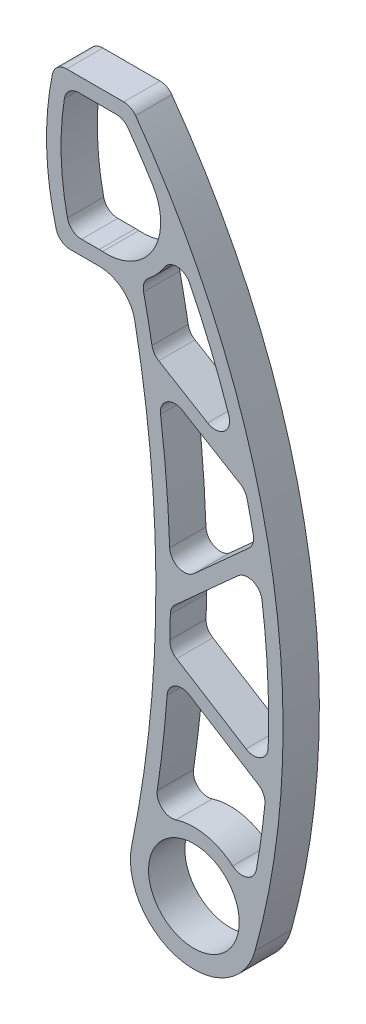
ISO-10303-21;
HEADER;
FILE_DESCRIPTION(('STEP AP214'),'2;1');
FILE_NAME('part.step','',(''),(''),'','','');
FILE_SCHEMA(('AUTOMOTIVE_DESIGN { 1 0 10303 214 1 1 1 1 }'));
ENDSEC;
DATA;
#1=APPLICATION_CONTEXT('core data for automotive mechanical design processes');
#2=APPLICATION_PROTOCOL_DEFINITION('international standard','automotive_design',2000,#1);
#3=PRODUCT_CONTEXT('',#1,'mechanical');
#4=PRODUCT('Part','Part','',(#3));
#5=PRODUCT_RELATED_PRODUCT_CATEGORY('part','',(#4));
#6=PRODUCT_DEFINITION_FORMATION('','',#4);
#7=PRODUCT_DEFINITION_CONTEXT('part definition',#1,'design');
#8=PRODUCT_DEFINITION('design','',#6,#7);
#9=PRODUCT_DEFINITION_SHAPE('','',#8);
#10=(LENGTH_UNIT() NAMED_UNIT(*) SI_UNIT(.MILLI.,.METRE.));
#11=(NAMED_UNIT(*) PLANE_ANGLE_UNIT() SI_UNIT($,.RADIAN.));
#12=(NAMED_UNIT(*) SI_UNIT($,.STERADIAN.) SOLID_ANGLE_UNIT());
#13=UNCERTAINTY_MEASURE_WITH_UNIT(LENGTH_MEASURE(1.E-05),#10,'distance_accuracy_value','');
#14=(GEOMETRIC_REPRESENTATION_CONTEXT(3) GLOBAL_UNCERTAINTY_ASSIGNED_CONTEXT((#13)) GLOBAL_UNIT_ASSIGNED_CONTEXT((#10,
#11,#12)) REPRESENTATION_CONTEXT('',''));
#15=CARTESIAN_POINT('',(0.,0.,0.));
#16=DIRECTION('',(0.,0.,1.));
#17=DIRECTION('',(1.,0.,0.));
#18=AXIS2_PLACEMENT_3D('',#15,#16,#17);
#19=CARTESIAN_POINT('',(-419.699454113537,87.0158539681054,-6.35));
#20=DIRECTION('',(0.,0.,1.));
#21=DIRECTION('',(1.,0.,0.));
#22=AXIS2_PLACEMENT_3D('',#19,#20,#21);
#23=CYLINDRICAL_SURFACE('',#22,411.48);
#24=CARTESIAN_POINT('',(-419.699454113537,87.0158539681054,-6.35));
#25=DIRECTION('',(0.,0.,-1.));
#26=DIRECTION('',(1.,0.,0.));
#27=AXIS2_PLACEMENT_3D('',#24,#25,#26);
#28=CIRCLE('',#27,411.48);
#29=CARTESIAN_POINT('',(-9.36909058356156,56.2785286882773,-6.35));
#30=VERTEX_POINT('',#29);
#31=CARTESIAN_POINT('',(-12.8293001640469,25.5954320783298,-6.35));
#32=VERTEX_POINT('',#31);
#33=EDGE_CURVE('E405',#30,#32,#28,.T.);
#34=ORIENTED_EDGE('',*,*,#33,.F.);
#35=DIRECTION('',(0.,0.,1.));
#36=VECTOR('',#35,1.);
#37=CARTESIAN_POINT('',(-9.36909058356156,56.2785286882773,-6.35));
#38=LINE('',#37,#36);
#39=CARTESIAN_POINT('',(-9.36909058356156,56.2785286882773,6.35));
#40=VERTEX_POINT('',#39);
#41=EDGE_CURVE('E59',#30,#40,#38,.T.);
#42=ORIENTED_EDGE('',*,*,#41,.T.);
#43=CARTESIAN_POINT('',(-419.699454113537,87.0158539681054,6.35));
#44=DIRECTION('',(0.,0.,-1.));
#45=DIRECTION('',(1.,0.,0.));
#46=AXIS2_PLACEMENT_3D('',#43,#44,#45);
#47=CIRCLE('',#46,411.48);
#48=CARTESIAN_POINT('',(-12.8293001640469,25.5954320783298,6.35));
#49=VERTEX_POINT('',#48);
#50=EDGE_CURVE('E428',#40,#49,#47,.T.);
#51=ORIENTED_EDGE('',*,*,#50,.T.);
#52=DIRECTION('',(0.,0.,1.));
#53=VECTOR('',#52,1.);
#54=CARTESIAN_POINT('',(-12.8293001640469,25.5954320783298,-6.35));
#55=LINE('',#54,#53);
#56=EDGE_CURVE('E440',#32,#49,#55,.T.);
#57=ORIENTED_EDGE('',*,*,#56,.F.);
#58=EDGE_LOOP('',(#34,#42,#51,#57));
#59=FACE_BOUND('',#58,.T.);
#60=ADVANCED_FACE('F37',(#59),#23,.T.);
#61=CARTESIAN_POINT('',(-241.803778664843,66.6641826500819,-6.35));
#62=DIRECTION('',(0.,0.,1.));
#63=DIRECTION('',(1.,0.,0.));
#64=AXIS2_PLACEMENT_3D('',#61,#62,#63);
#65=CYLINDRICAL_SURFACE('',#64,267.97);
#66=CARTESIAN_POINT('',(-241.803778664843,66.6641826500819,6.35));
#67=DIRECTION('',(0.,0.,1.));
#68=DIRECTION('',(1.,0.,0.));
#69=AXIS2_PLACEMENT_3D('',#66,#67,#68);
#70=CIRCLE('',#69,267.97);
#71=CARTESIAN_POINT('',(21.8780476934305,18.9167706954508,6.35));
#72=VERTEX_POINT('',#71);
#73=CARTESIAN_POINT('',(24.8708165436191,40.3472457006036,6.35));
#74=VERTEX_POINT('',#73);
#75=EDGE_CURVE('E416',#72,#74,#70,.T.);
#76=ORIENTED_EDGE('',*,*,#75,.T.);
#77=DIRECTION('',(0.,0.,1.));
#78=VECTOR('',#77,1.);
#79=CARTESIAN_POINT('',(24.8708165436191,40.3472457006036,-6.35));
#80=LINE('',#79,#78);
#81=CARTESIAN_POINT('',(24.8708165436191,40.3472457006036,-6.35));
#82=VERTEX_POINT('',#81);
#83=EDGE_CURVE('E377',#74,#82,#80,.F.);
#84=ORIENTED_EDGE('',*,*,#83,.T.);
#85=CARTESIAN_POINT('',(-241.803778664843,66.6641826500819,-6.35));
#86=DIRECTION('',(0.,0.,1.));
#87=DIRECTION('',(1.,0.,0.));
#88=AXIS2_PLACEMENT_3D('',#85,#86,#87);
#89=CIRCLE('',#88,267.97);
#90=CARTESIAN_POINT('',(21.8780476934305,18.9167706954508,-6.35));
#91=VERTEX_POINT('',#90);
#92=EDGE_CURVE('E374',#91,#82,#89,.T.);
#93=ORIENTED_EDGE('',*,*,#92,.F.);
#94=DIRECTION('',(0.,0.,1.));
#95=VECTOR('',#94,1.);
#96=CARTESIAN_POINT('',(21.8780476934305,18.9167706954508,-6.35));
#97=LINE('',#96,#95);
#98=EDGE_CURVE('E359',#91,#72,#97,.T.);
#99=ORIENTED_EDGE('',*,*,#98,.T.);
#100=EDGE_LOOP('',(#76,#84,#93,#99));
#101=FACE_BOUND('',#100,.T.);
#102=ADVANCED_FACE('F375',(#101),#65,.F.);
#103=CARTESIAN_POINT('',(-11.684548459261,140.304006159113,-6.35));
#104=VERTEX_POINT('',#103);
#105=CARTESIAN_POINT('',(-8.47092517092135,101.399434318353,-6.35));
#106=VERTEX_POINT('',#105);
#107=EDGE_CURVE('E410',#104,#106,#28,.T.);
#108=ORIENTED_EDGE('',*,*,#107,.F.);
#109=DIRECTION('',(0.,0.,1.));
#110=VECTOR('',#109,1.);
#111=CARTESIAN_POINT('',(-11.6845484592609,140.304006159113,-6.35));
#112=LINE('',#111,#110);
#113=CARTESIAN_POINT('',(-11.684548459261,140.304006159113,6.35));
#114=VERTEX_POINT('',#113);
#115=EDGE_CURVE('E628',#104,#114,#112,.T.);
#116=ORIENTED_EDGE('',*,*,#115,.T.);
#117=CARTESIAN_POINT('',(-8.47092517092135,101.399434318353,6.35));
#118=VERTEX_POINT('',#117);
#119=EDGE_CURVE('E432',#114,#118,#47,.T.);
#120=ORIENTED_EDGE('',*,*,#119,.T.);
#121=DIRECTION('',(0.,0.,1.));
#122=VECTOR('',#121,1.);
#123=CARTESIAN_POINT('',(-8.47092517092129,101.399434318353,-6.35));
#124=LINE('',#123,#122);
#125=EDGE_CURVE('E626',#118,#106,#124,.F.);
#126=ORIENTED_EDGE('',*,*,#125,.T.);
#127=EDGE_LOOP('',(#108,#116,#120,#126));
#128=FACE_BOUND('',#127,.T.);
#129=ADVANCED_FACE('F787',(#128),#23,.T.);
#130=CARTESIAN_POINT('',(20.8206116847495,119.921581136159,6.35));
#131=VERTEX_POINT('',#130);
#132=CARTESIAN_POINT('',(18.578522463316,129.980674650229,6.35));
#133=VERTEX_POINT('',#132);
#134=EDGE_CURVE('E730',#131,#133,#70,.T.);
#135=ORIENTED_EDGE('',*,*,#134,.T.);
#136=DIRECTION('',(0.,0.,1.));
#137=VECTOR('',#136,1.);
#138=CARTESIAN_POINT('',(18.578522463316,129.980674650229,-6.35));
#139=LINE('',#138,#137);
#140=CARTESIAN_POINT('',(18.578522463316,129.980674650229,-6.35));
#141=VERTEX_POINT('',#140);
#142=EDGE_CURVE('E624',#133,#141,#139,.F.);
#143=ORIENTED_EDGE('',*,*,#142,.T.);
#144=CARTESIAN_POINT('',(20.8206116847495,119.921581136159,-6.35));
#145=VERTEX_POINT('',#144);
#146=EDGE_CURVE('E389',#145,#141,#89,.T.);
#147=ORIENTED_EDGE('',*,*,#146,.F.);
#148=DIRECTION('',(0.,0.,1.));
#149=VECTOR('',#148,1.);
#150=CARTESIAN_POINT('',(20.8206116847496,119.921581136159,-6.35));
#151=LINE('',#150,#149);
#152=EDGE_CURVE('E622',#145,#131,#151,.T.);
#153=ORIENTED_EDGE('',*,*,#152,.T.);
#154=EDGE_LOOP('',(#135,#143,#147,#153));
#155=FACE_BOUND('',#154,.T.);
#156=ADVANCED_FACE('F720',(#155),#65,.F.);
#157=CARTESIAN_POINT('',(-8.25880205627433,81.3254906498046,-6.35));
#158=VERTEX_POINT('',#157);
#159=CARTESIAN_POINT('',(-8.44326143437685,73.4462414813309,-6.35));
#160=VERTEX_POINT('',#159);
#161=EDGE_CURVE('E822',#158,#160,#28,.T.);
#162=ORIENTED_EDGE('',*,*,#161,.F.);
#163=DIRECTION('',(0.,0.,1.));
#164=VECTOR('',#163,1.);
#165=CARTESIAN_POINT('',(-8.25880205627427,81.3254906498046,-6.35));
#166=LINE('',#165,#164);
#167=CARTESIAN_POINT('',(-8.25880205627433,81.3254906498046,6.35));
#168=VERTEX_POINT('',#167);
#169=EDGE_CURVE('E649',#158,#168,#166,.T.);
#170=ORIENTED_EDGE('',*,*,#169,.T.);
#171=CARTESIAN_POINT('',(-8.44326143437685,73.4462414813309,6.35));
#172=VERTEX_POINT('',#171);
#173=EDGE_CURVE('E833',#168,#172,#47,.T.);
#174=ORIENTED_EDGE('',*,*,#173,.T.);
#175=DIRECTION('',(0.,0.,1.));
#176=VECTOR('',#175,1.);
#177=CARTESIAN_POINT('',(-8.44326143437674,73.4462414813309,-6.35));
#178=LINE('',#177,#176);
#179=EDGE_CURVE('E646',#172,#160,#178,.F.);
#180=ORIENTED_EDGE('',*,*,#179,.T.);
#181=EDGE_LOOP('',(#162,#170,#174,#180));
#182=FACE_BOUND('',#181,.T.);
#183=ADVANCED_FACE('F798',(#182),#23,.T.);
#184=CARTESIAN_POINT('',(26.024142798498,57.9391964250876,6.35));
#185=VERTEX_POINT('',#184);
#186=CARTESIAN_POINT('',(23.8595658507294,101.748485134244,6.35));
#187=VERTEX_POINT('',#186);
#188=EDGE_CURVE('E419',#185,#187,#70,.T.);
#189=ORIENTED_EDGE('',*,*,#188,.T.);
#190=DIRECTION('',(0.,0.,1.));
#191=VECTOR('',#190,1.);
#192=CARTESIAN_POINT('',(23.8595658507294,101.748485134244,-6.35));
#193=LINE('',#192,#191);
#194=CARTESIAN_POINT('',(23.8595658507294,101.748485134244,-6.35));
#195=VERTEX_POINT('',#194);
#196=EDGE_CURVE('E639',#187,#195,#193,.F.);
#197=ORIENTED_EDGE('',*,*,#196,.T.);
#198=CARTESIAN_POINT('',(26.024142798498,57.9391964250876,-6.35));
#199=VERTEX_POINT('',#198);
#200=EDGE_CURVE('E380',#199,#195,#89,.T.);
#201=ORIENTED_EDGE('',*,*,#200,.F.);
#202=DIRECTION('',(0.,0.,1.));
#203=VECTOR('',#202,1.);
#204=CARTESIAN_POINT('',(26.0241427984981,57.9391964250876,-6.35));
#205=LINE('',#204,#203);
#206=EDGE_CURVE('E636',#199,#185,#205,.T.);
#207=ORIENTED_EDGE('',*,*,#206,.T.);
#208=EDGE_LOOP('',(#189,#197,#201,#207));
#209=FACE_BOUND('',#208,.T.);
#210=ADVANCED_FACE('F812',(#209),#65,.F.);
#211=CARTESIAN_POINT('',(-419.699454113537,87.0158539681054,6.35));
#212=DIRECTION('',(0.,0.,-1.));
#213=DIRECTION('',(-1.,0.,0.));
#214=AXIS2_PLACEMENT_3D('',#211,#212,#213);
#215=CYLINDRICAL_SURFACE('',#214,406.4);
#216=CARTESIAN_POINT('',(-419.699454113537,87.0158539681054,-6.35));
#217=DIRECTION('',(0.,0.,1.));
#218=DIRECTION('',(1.,0.,0.));
#219=AXIS2_PLACEMENT_3D('',#216,#217,#218);
#220=CIRCLE('',#219,406.4);
#221=CARTESIAN_POINT('',(-21.7621939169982,4.51193316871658,-6.35));
#222=VERTEX_POINT('',#221);
#223=CARTESIAN_POINT('',(-20.6923861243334,164.180092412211,-6.35));
#224=VERTEX_POINT('',#223);
#225=EDGE_CURVE('E506',#222,#224,#220,.T.);
#226=ORIENTED_EDGE('',*,*,#225,.F.);
#227=DIRECTION('',(0.,0.,-1.));
#228=VECTOR('',#227,1.);
#229=CARTESIAN_POINT('',(-21.7621939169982,4.51193316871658,6.35));
#230=LINE('',#229,#228);
#231=CARTESIAN_POINT('',(-21.7621939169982,4.51193316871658,6.35));
#232=VERTEX_POINT('',#231);
#233=EDGE_CURVE('E604',#232,#222,#230,.T.);
#234=ORIENTED_EDGE('',*,*,#233,.F.);
#235=CARTESIAN_POINT('',(-419.699454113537,87.0158539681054,6.35));
#236=DIRECTION('',(0.,0.,1.));
#237=DIRECTION('',(1.,0.,0.));
#238=AXIS2_PLACEMENT_3D('',#235,#236,#237);
#239=CIRCLE('',#238,406.4);
#240=CARTESIAN_POINT('',(-20.6923861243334,164.180092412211,6.35));
#241=VERTEX_POINT('',#240);
#242=EDGE_CURVE('E523',#232,#241,#239,.T.);
#243=ORIENTED_EDGE('',*,*,#242,.T.);
#244=DIRECTION('',(0.,0.,-1.));
#245=VECTOR('',#244,1.);
#246=CARTESIAN_POINT('',(-20.6923861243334,164.180092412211,6.35));
#247=LINE('',#246,#245);
#248=EDGE_CURVE('E555',#241,#224,#247,.T.);
#249=ORIENTED_EDGE('',*,*,#248,.T.);
#250=EDGE_LOOP('',(#226,#234,#243,#249));
#251=FACE_BOUND('',#250,.T.);
#252=ADVANCED_FACE('F818',(#251),#215,.F.);
#253=CARTESIAN_POINT('',(0.,0.,6.35));
#254=DIRECTION('',(0.,0.,-1.));
#255=DIRECTION('',(-1.,0.,0.));
#256=AXIS2_PLACEMENT_3D('',#253,#254,#255);
#257=CYLINDRICAL_SURFACE('',#256,22.225);
#258=CARTESIAN_POINT('',(0.,0.,-6.35));
#259=DIRECTION('',(0.,0.,1.));
#260=DIRECTION('',(1.,0.,0.));
#261=AXIS2_PLACEMENT_3D('',#258,#259,#260);
#262=CIRCLE('',#261,22.225);
#263=CARTESIAN_POINT('',(21.4256512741,-5.90695289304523,-6.35));
#264=VERTEX_POINT('',#263);
#265=EDGE_CURVE('E558',#222,#264,#262,.T.);
#266=ORIENTED_EDGE('',*,*,#265,.T.);
#267=DIRECTION('',(0.,0.,-1.));
#268=VECTOR('',#267,1.);
#269=CARTESIAN_POINT('',(21.4256512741,-5.90695289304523,6.35));
#270=LINE('',#269,#268);
#271=CARTESIAN_POINT('',(21.4256512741,-5.90695289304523,6.35));
#272=VERTEX_POINT('',#271);
#273=EDGE_CURVE('E601',#272,#264,#270,.T.);
#274=ORIENTED_EDGE('',*,*,#273,.F.);
#275=CARTESIAN_POINT('',(0.,0.,6.35));
#276=DIRECTION('',(0.,0.,1.));
#277=DIRECTION('',(1.,0.,0.));
#278=AXIS2_PLACEMENT_3D('',#275,#276,#277);
#279=CIRCLE('',#278,22.225);
#280=EDGE_CURVE('E526',#232,#272,#279,.T.);
#281=ORIENTED_EDGE('',*,*,#280,.F.);
#282=ORIENTED_EDGE('',*,*,#233,.T.);
#283=EDGE_LOOP('',(#266,#274,#281,#282));
#284=FACE_BOUND('',#283,.T.);
#285=ADVANCED_FACE('F1187',(#284),#257,.T.);
#286=CARTESIAN_POINT('',(-241.803778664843,66.6641826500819,6.35));
#287=DIRECTION('',(0.,0.,-1.));
#288=DIRECTION('',(-1.,0.,0.));
#289=AXIS2_PLACEMENT_3D('',#286,#287,#288);
#290=CYLINDRICAL_SURFACE('',#289,273.05);
#291=CARTESIAN_POINT('',(-241.803778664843,66.6641826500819,-6.35));
#292=DIRECTION('',(0.,0.,1.));
#293=DIRECTION('',(1.,0.,0.));
#294=AXIS2_PLACEMENT_3D('',#291,#292,#293);
#295=CIRCLE('',#294,273.05);
#296=CARTESIAN_POINT('',(-20.4197922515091,226.493569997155,-6.35));
#297=VERTEX_POINT('',#296);
#298=EDGE_CURVE('E560',#264,#297,#295,.T.);
#299=ORIENTED_EDGE('',*,*,#298,.T.);
#300=DIRECTION('',(0.,0.,-1.));
#301=VECTOR('',#300,1.);
#302=CARTESIAN_POINT('',(-20.4197922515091,226.493569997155,6.35));
#303=LINE('',#302,#301);
#304=CARTESIAN_POINT('',(-20.4197922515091,226.493569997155,6.35));
#305=VERTEX_POINT('',#304);
#306=EDGE_CURVE('E599',#305,#297,#303,.T.);
#307=ORIENTED_EDGE('',*,*,#306,.F.);
#308=CARTESIAN_POINT('',(-241.803778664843,66.6641826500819,6.35));
#309=DIRECTION('',(0.,0.,1.));
#310=DIRECTION('',(1.,0.,0.));
#311=AXIS2_PLACEMENT_3D('',#308,#309,#310);
#312=CIRCLE('',#311,273.05);
#313=EDGE_CURVE('E529',#272,#305,#312,.T.);
#314=ORIENTED_EDGE('',*,*,#313,.F.);
#315=ORIENTED_EDGE('',*,*,#273,.T.);
#316=EDGE_LOOP('',(#299,#307,#314,#315));
#317=FACE_BOUND('',#316,.T.);
#318=ADVANCED_FACE('F1184',(#317),#290,.T.);
#319=CARTESIAN_POINT('',(-24.5385640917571,223.52,6.35));
#320=DIRECTION('',(0.,0.,-1.));
#321=DIRECTION('',(-1.,0.,0.));
#322=AXIS2_PLACEMENT_3D('',#319,#320,#321);
#323=CYLINDRICAL_SURFACE('',#322,5.07999999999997);
#324=CARTESIAN_POINT('',(-24.5385640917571,223.52,-6.35));
#325=DIRECTION('',(0.,0.,1.));
#326=DIRECTION('',(1.,0.,0.));
#327=AXIS2_PLACEMENT_3D('',#324,#325,#326);
#328=CIRCLE('',#327,5.07999999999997);
#329=CARTESIAN_POINT('',(-24.5385640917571,228.6,-6.35));
#330=VERTEX_POINT('',#329);
#331=EDGE_CURVE('E563',#330,#297,#328,.F.);
#332=ORIENTED_EDGE('',*,*,#331,.F.);
#333=DIRECTION('',(0.,0.,-1.));
#334=VECTOR('',#333,1.);
#335=CARTESIAN_POINT('',(-24.5385640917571,228.6,6.35));
#336=LINE('',#335,#334);
#337=CARTESIAN_POINT('',(-24.5385640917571,228.6,6.35));
#338=VERTEX_POINT('',#337);
#339=EDGE_CURVE('E597',#338,#330,#336,.T.);
#340=ORIENTED_EDGE('',*,*,#339,.F.);
#341=CARTESIAN_POINT('',(-24.5385640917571,223.52,6.35));
#342=DIRECTION('',(0.,0.,1.));
#343=DIRECTION('',(1.,0.,0.));
#344=AXIS2_PLACEMENT_3D('',#341,#342,#343);
#345=CIRCLE('',#344,5.07999999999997);
#346=EDGE_CURVE('E531',#338,#305,#345,.F.);
#347=ORIENTED_EDGE('',*,*,#346,.T.);
#348=ORIENTED_EDGE('',*,*,#306,.T.);
#349=EDGE_LOOP('',(#332,#340,#347,#348));
#350=FACE_BOUND('',#349,.T.);
#351=ADVANCED_FACE('F1180',(#350),#323,.T.);
#352=CARTESIAN_POINT('',(3.16644883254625E-13,228.6,6.35));
#353=DIRECTION('',(0.,1.,0.));
#354=DIRECTION('',(-1.,0.,0.));
#355=AXIS2_PLACEMENT_3D('',#352,#353,#354);
#356=PLANE('',#355);
#357=DIRECTION('',(1.,0.,0.));
#358=VECTOR('',#357,1.);
#359=CARTESIAN_POINT('',(3.16644883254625E-13,228.6,-6.35));
#360=LINE('',#359,#358);
#361=CARTESIAN_POINT('',(-44.5765464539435,228.6,-6.35));
#362=VERTEX_POINT('',#361);
#363=EDGE_CURVE('E566',#362,#330,#360,.T.);
#364=ORIENTED_EDGE('',*,*,#363,.F.);
#365=DIRECTION('',(0.,0.,-1.));
#366=VECTOR('',#365,1.);
#367=CARTESIAN_POINT('',(-44.5765464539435,228.6,6.35));
#368=LINE('',#367,#366);
#369=CARTESIAN_POINT('',(-44.5765464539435,228.6,6.35));
#370=VERTEX_POINT('',#369);
#371=EDGE_CURVE('E595',#370,#362,#368,.T.);
#372=ORIENTED_EDGE('',*,*,#371,.F.);
#373=DIRECTION('',(1.,0.,0.));
#374=VECTOR('',#373,1.);
#375=CARTESIAN_POINT('',(3.16644883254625E-13,228.6,6.35));
#376=LINE('',#375,#374);
#377=EDGE_CURVE('E534',#370,#338,#376,.T.);
#378=ORIENTED_EDGE('',*,*,#377,.T.);
#379=ORIENTED_EDGE('',*,*,#339,.T.);
#380=EDGE_LOOP('',(#364,#372,#378,#379));
#381=FACE_BOUND('',#380,.T.);
#382=ADVANCED_FACE('F1176',(#381),#356,.T.);
#383=CARTESIAN_POINT('',(-44.5765464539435,223.52,6.35));
#384=DIRECTION('',(0.,0.,-1.));
#385=DIRECTION('',(-1.,0.,0.));
#386=AXIS2_PLACEMENT_3D('',#383,#384,#385);
#387=CYLINDRICAL_SURFACE('',#386,5.08);
#388=CARTESIAN_POINT('',(-44.5765464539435,223.52,-6.35));
#389=DIRECTION('',(0.,0.,1.));
#390=DIRECTION('',(1.,0.,0.));
#391=AXIS2_PLACEMENT_3D('',#388,#389,#390);
#392=CIRCLE('',#391,5.08);
#393=CARTESIAN_POINT('',(-49.553909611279,224.536,-6.35));
#394=VERTEX_POINT('',#393);
#395=EDGE_CURVE('E569',#394,#362,#392,.F.);
#396=ORIENTED_EDGE('',*,*,#395,.F.);
#397=DIRECTION('',(0.,0.,-1.));
#398=VECTOR('',#397,1.);
#399=CARTESIAN_POINT('',(-49.553909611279,224.536,6.35));
#400=LINE('',#399,#398);
#401=CARTESIAN_POINT('',(-49.553909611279,224.536,6.35));
#402=VERTEX_POINT('',#401);
#403=EDGE_CURVE('E593',#402,#394,#400,.T.);
#404=ORIENTED_EDGE('',*,*,#403,.F.);
#405=CARTESIAN_POINT('',(-44.5765464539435,223.52,6.35));
#406=DIRECTION('',(0.,0.,1.));
#407=DIRECTION('',(1.,0.,0.));
#408=AXIS2_PLACEMENT_3D('',#405,#406,#407);
#409=CIRCLE('',#408,5.08);
#410=EDGE_CURVE('E537',#402,#370,#409,.F.);
#411=ORIENTED_EDGE('',*,*,#410,.T.);
#412=ORIENTED_EDGE('',*,*,#371,.T.);
#413=EDGE_LOOP('',(#396,#404,#411,#412));
#414=FACE_BOUND('',#413,.T.);
#415=ADVANCED_FACE('F1172',(#414),#387,.T.);
#416=CARTESIAN_POINT('',(49.9933535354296,204.216,6.35));
#417=DIRECTION('',(0.,0.,-1.));
#418=DIRECTION('',(-1.,0.,0.));
#419=AXIS2_PLACEMENT_3D('',#416,#417,#418);
#420=CYLINDRICAL_SURFACE('',#419,101.6);
#421=CARTESIAN_POINT('',(49.9933535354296,204.216,-6.35));
#422=DIRECTION('',(0.,0.,1.));
#423=DIRECTION('',(1.,0.,0.));
#424=AXIS2_PLACEMENT_3D('',#421,#422,#423);
#425=CIRCLE('',#424,101.6);
#426=CARTESIAN_POINT('',(-48.2326575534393,178.250431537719,-6.35));
#427=VERTEX_POINT('',#426);
#428=EDGE_CURVE('E572',#427,#394,#425,.F.);
#429=ORIENTED_EDGE('',*,*,#428,.F.);
#430=DIRECTION('',(0.,0.,-1.));
#431=VECTOR('',#430,1.);
#432=CARTESIAN_POINT('',(-48.2326575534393,178.250431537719,6.35));
#433=LINE('',#432,#431);
#434=CARTESIAN_POINT('',(-48.2326575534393,178.250431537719,6.35));
#435=VERTEX_POINT('',#434);
#436=EDGE_CURVE('E591',#435,#427,#433,.T.);
#437=ORIENTED_EDGE('',*,*,#436,.F.);
#438=CARTESIAN_POINT('',(49.9933535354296,204.216,6.35));
#439=DIRECTION('',(0.,0.,1.));
#440=DIRECTION('',(1.,0.,0.));
#441=AXIS2_PLACEMENT_3D('',#438,#439,#440);
#442=CIRCLE('',#441,101.6);
#443=EDGE_CURVE('E540',#435,#402,#442,.F.);
#444=ORIENTED_EDGE('',*,*,#443,.T.);
#445=ORIENTED_EDGE('',*,*,#403,.T.);
#446=EDGE_LOOP('',(#429,#437,#444,#445));
#447=FACE_BOUND('',#446,.T.);
#448=ADVANCED_FACE('F1168',(#447),#420,.T.);
#449=CARTESIAN_POINT('',(-43.3213569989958,179.548709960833,6.35));
#450=DIRECTION('',(0.,0.,-1.));
#451=DIRECTION('',(-1.,0.,0.));
#452=AXIS2_PLACEMENT_3D('',#449,#450,#451);
#453=CYLINDRICAL_SURFACE('',#452,5.08000000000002);
#454=CARTESIAN_POINT('',(-43.3213569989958,179.548709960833,-6.35));
#455=DIRECTION('',(0.,0.,1.));
#456=DIRECTION('',(1.,0.,0.));
#457=AXIS2_PLACEMENT_3D('',#454,#455,#456);
#458=CIRCLE('',#457,5.08000000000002);
#459=CARTESIAN_POINT('',(-43.3213569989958,174.468709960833,-6.35));
#460=VERTEX_POINT('',#459);
#461=EDGE_CURVE('E575',#460,#427,#458,.F.);
#462=ORIENTED_EDGE('',*,*,#461,.F.);
#463=DIRECTION('',(0.,0.,-1.));
#464=VECTOR('',#463,1.);
#465=CARTESIAN_POINT('',(-43.3213569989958,174.468709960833,6.35));
#466=LINE('',#465,#464);
#467=CARTESIAN_POINT('',(-43.3213569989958,174.468709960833,6.35));
#468=VERTEX_POINT('',#467);
#469=EDGE_CURVE('E589',#468,#460,#466,.T.);
#470=ORIENTED_EDGE('',*,*,#469,.F.);
#471=CARTESIAN_POINT('',(-43.3213569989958,179.548709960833,6.35));
#472=DIRECTION('',(0.,0.,1.));
#473=DIRECTION('',(1.,0.,0.));
#474=AXIS2_PLACEMENT_3D('',#471,#472,#473);
#475=CIRCLE('',#474,5.08000000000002);
#476=EDGE_CURVE('E543',#468,#435,#475,.F.);
#477=ORIENTED_EDGE('',*,*,#476,.T.);
#478=ORIENTED_EDGE('',*,*,#436,.T.);
#479=EDGE_LOOP('',(#462,#470,#477,#478));
#480=FACE_BOUND('',#479,.T.);
#481=ADVANCED_FACE('F1164',(#480),#453,.T.);
#482=CARTESIAN_POINT('',(0.,174.468709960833,6.35));
#483=DIRECTION('',(0.,-1.,0.));
#484=DIRECTION('',(0.,0.,-1.));
#485=AXIS2_PLACEMENT_3D('',#482,#483,#484);
#486=PLANE('',#485);
#487=DIRECTION('',(-1.,0.,0.));
#488=VECTOR('',#487,1.);
#489=CARTESIAN_POINT('',(0.,174.468709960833,-6.35));
#490=LINE('',#489,#488);
#491=CARTESIAN_POINT('',(-33.1613569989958,174.468709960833,-6.35));
#492=VERTEX_POINT('',#491);
#493=EDGE_CURVE('E578',#492,#460,#490,.T.);
#494=ORIENTED_EDGE('',*,*,#493,.F.);
#495=DIRECTION('',(0.,0.,-1.));
#496=VECTOR('',#495,1.);
#497=CARTESIAN_POINT('',(-33.1613569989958,174.468709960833,6.35));
#498=LINE('',#497,#496);
#499=CARTESIAN_POINT('',(-33.1613569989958,174.468709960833,6.35));
#500=VERTEX_POINT('',#499);
#501=EDGE_CURVE('E587',#500,#492,#498,.T.);
#502=ORIENTED_EDGE('',*,*,#501,.F.);
#503=DIRECTION('',(-1.,0.,0.));
#504=VECTOR('',#503,1.);
#505=CARTESIAN_POINT('',(0.,174.468709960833,6.35));
#506=LINE('',#505,#504);
#507=EDGE_CURVE('E546',#500,#468,#506,.T.);
#508=ORIENTED_EDGE('',*,*,#507,.T.);
#509=ORIENTED_EDGE('',*,*,#469,.T.);
#510=EDGE_LOOP('',(#494,#502,#508,#509));
#511=FACE_BOUND('',#510,.T.);
#512=ADVANCED_FACE('F1160',(#511),#486,.T.);
#513=CARTESIAN_POINT('',(-33.1613569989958,161.768709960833,6.35));
#514=DIRECTION('',(0.,0.,-1.));
#515=DIRECTION('',(-1.,0.,0.));
#516=AXIS2_PLACEMENT_3D('',#513,#514,#515);
#517=CYLINDRICAL_SURFACE('',#516,12.7);
#518=CARTESIAN_POINT('',(-33.1613569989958,161.768709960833,-6.35));
#519=DIRECTION('',(0.,0.,1.));
#520=DIRECTION('',(1.,0.,0.));
#521=AXIS2_PLACEMENT_3D('',#518,#519,#520);
#522=CIRCLE('',#521,12.7);
#523=EDGE_CURVE('E581',#224,#492,#522,.T.);
#524=ORIENTED_EDGE('',*,*,#523,.F.);
#525=ORIENTED_EDGE('',*,*,#248,.F.);
#526=CARTESIAN_POINT('',(-33.1613569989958,161.768709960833,6.35));
#527=DIRECTION('',(0.,0.,1.));
#528=DIRECTION('',(1.,0.,0.));
#529=AXIS2_PLACEMENT_3D('',#526,#527,#528);
#530=CIRCLE('',#529,12.7);
#531=EDGE_CURVE('E549',#241,#500,#530,.T.);
#532=ORIENTED_EDGE('',*,*,#531,.T.);
#533=ORIENTED_EDGE('',*,*,#501,.T.);
#534=EDGE_LOOP('',(#524,#525,#532,#533));
#535=FACE_BOUND('',#534,.T.);
#536=ADVANCED_FACE('F1156',(#535),#517,.F.);
#537=CARTESIAN_POINT('',(0.,0.,6.35));
#538=DIRECTION('',(0.,0.,-1.));
#539=DIRECTION('',(-1.,0.,0.));
#540=AXIS2_PLACEMENT_3D('',#537,#538,#539);
#541=CYLINDRICAL_SURFACE('',#540,15.875);
#542=CARTESIAN_POINT('',(0.,0.,6.35));
#543=DIRECTION('',(0.,0.,1.));
#544=DIRECTION('',(1.,0.,0.));
#545=AXIS2_PLACEMENT_3D('',#542,#543,#544);
#546=CIRCLE('',#545,15.875);
#547=CARTESIAN_POINT('',(15.875,0.,6.35));
#548=VERTEX_POINT('',#547);
#549=EDGE_CURVE('E552',#548,#548,#546,.T.);
#550=ORIENTED_EDGE('',*,*,#549,.T.);
#551=EDGE_LOOP('',(#550));
#552=FACE_BOUND('',#551,.T.);
#553=CARTESIAN_POINT('',(0.,0.,-6.35));
#554=DIRECTION('',(0.,0.,1.));
#555=DIRECTION('',(1.,0.,0.));
#556=AXIS2_PLACEMENT_3D('',#553,#554,#555);
#557=CIRCLE('',#556,15.875);
#558=CARTESIAN_POINT('',(15.875,0.,-6.35));
#559=VERTEX_POINT('',#558);
#560=EDGE_CURVE('E527',#559,#559,#557,.T.);
#561=ORIENTED_EDGE('',*,*,#560,.F.);
#562=EDGE_LOOP('',(#561));
#563=FACE_BOUND('',#562,.T.);
#564=ADVANCED_FACE('F1041',(#552,#563),#541,.F.);
#565=CARTESIAN_POINT('',(0.,0.,6.35));
#566=DIRECTION('',(0.,0.,1.));
#567=DIRECTION('',(1.,0.,0.));
#568=AXIS2_PLACEMENT_3D('',#565,#566,#567);
#569=PLANE('',#568);
#570=ORIENTED_EDGE('',*,*,#50,.F.);
#571=CARTESIAN_POINT('',(-4.30328362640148,55.8990555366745,6.35));
#572=DIRECTION('',(0.,0.,1.));
#573=DIRECTION('',(1.,0.,0.));
#574=AXIS2_PLACEMENT_3D('',#571,#572,#573);
#575=CIRCLE('',#574,5.08);
#576=CARTESIAN_POINT('',(-1.61362001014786,60.2085925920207,6.35));
#577=VERTEX_POINT('',#576);
#578=EDGE_CURVE('E705',#40,#577,#575,.F.);
#579=ORIENTED_EDGE('',*,*,#578,.T.);
#580=DIRECTION('',(-0.848334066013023,0.529461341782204,0.));
#581=VECTOR('',#580,1.);
#582=CARTESIAN_POINT('',(26.478805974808,42.6755780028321,6.35));
#583=LINE('',#582,#581);
#584=CARTESIAN_POINT('',(22.5050375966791,45.1556820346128,6.35));
#585=VERTEX_POINT('',#584);
#586=EDGE_CURVE('E756',#585,#577,#583,.T.);
#587=ORIENTED_EDGE('',*,*,#586,.F.);
#588=CARTESIAN_POINT('',(19.8153739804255,40.8461449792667,6.35));
#589=DIRECTION('',(0.,0.,1.));
#590=DIRECTION('',(1.,0.,0.));
#591=AXIS2_PLACEMENT_3D('',#588,#589,#590);
#592=CIRCLE('',#591,5.08);
#593=EDGE_CURVE('E700',#585,#74,#592,.F.);
#594=ORIENTED_EDGE('',*,*,#593,.T.);
#595=ORIENTED_EDGE('',*,*,#75,.F.);
#596=CARTESIAN_POINT('',(16.8793400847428,19.8219349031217,6.35));
#597=DIRECTION('',(0.,0.,1.));
#598=DIRECTION('',(1.,0.,0.));
#599=AXIS2_PLACEMENT_3D('',#596,#597,#598);
#600=CIRCLE('',#599,5.08);
#601=CARTESIAN_POINT('',(13.5858103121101,15.9542402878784,6.35));
#602=VERTEX_POINT('',#601);
#603=EDGE_CURVE('E366',#602,#72,#600,.T.);
#604=ORIENTED_EDGE('',*,*,#603,.F.);
#605=CARTESIAN_POINT('',(0.,0.,6.35));
#606=DIRECTION('',(0.,0.,-1.));
#607=DIRECTION('',(1.,0.,0.));
#608=AXIS2_PLACEMENT_3D('',#605,#606,#607);
#609=CIRCLE('',#608,20.955);
#610=CARTESIAN_POINT('',(-6.28304855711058,19.9908810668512,6.35));
#611=VERTEX_POINT('',#610);
#612=EDGE_CURVE('E387',#611,#602,#609,.T.);
#613=ORIENTED_EDGE('',*,*,#612,.F.);
#614=CARTESIAN_POINT('',(-7.80621184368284,24.8371552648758,6.35));
#615=DIRECTION('',(0.,0.,1.));
#616=DIRECTION('',(-1.,0.,0.));
#617=AXIS2_PLACEMENT_3D('',#614,#615,#616);
#618=CIRCLE('',#617,5.08);
#619=EDGE_CURVE('E391',#49,#611,#618,.T.);
#620=ORIENTED_EDGE('',*,*,#619,.F.);
#621=EDGE_LOOP('',(#570,#579,#587,#594,#595,#604,#613,#620));
#622=FACE_BOUND('',#621,.T.);
#623=ORIENTED_EDGE('',*,*,#188,.F.);
#624=CARTESIAN_POINT('',(20.9468362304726,58.104599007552,6.35));
#625=DIRECTION('',(0.,0.,1.));
#626=DIRECTION('',(1.,0.,0.));
#627=AXIS2_PLACEMENT_3D('',#624,#625,#626);
#628=CIRCLE('',#627,5.08);
#629=CARTESIAN_POINT('',(18.2571726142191,53.7950619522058,6.35));
#630=VERTEX_POINT('',#629);
#631=EDGE_CURVE('E696',#185,#630,#628,.F.);
#632=ORIENTED_EDGE('',*,*,#631,.T.);
#633=DIRECTION('',(-0.848334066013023,0.529461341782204,0.));
#634=VECTOR('',#633,1.);
#635=CARTESIAN_POINT('',(29.1684695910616,46.9851150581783,6.35));
#636=LINE('',#635,#634);
#637=CARTESIAN_POINT('',(-6.05568810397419,68.9691783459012,6.35));
#638=VERTEX_POINT('',#637);
#639=EDGE_CURVE('E760',#630,#638,#636,.T.);
#640=ORIENTED_EDGE('',*,*,#639,.T.);
#641=CARTESIAN_POINT('',(-3.36602448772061,73.2787154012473,6.35));
#642=DIRECTION('',(0.,0.,1.));
#643=DIRECTION('',(1.,0.,0.));
#644=AXIS2_PLACEMENT_3D('',#641,#642,#643);
#645=CIRCLE('',#644,5.08);
#646=EDGE_CURVE('E694',#638,#172,#645,.F.);
#647=ORIENTED_EDGE('',*,*,#646,.T.);
#648=ORIENTED_EDGE('',*,*,#173,.F.);
#649=CARTESIAN_POINT('',(-3.17928783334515,81.2552392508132,6.35));
#650=DIRECTION('',(0.,0.,1.));
#651=DIRECTION('',(1.,0.,0.));
#652=AXIS2_PLACEMENT_3D('',#649,#650,#651);
#653=CIRCLE('',#652,5.08);
#654=CARTESIAN_POINT('',(-6.58007434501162,85.0289709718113,6.35));
#655=VERTEX_POINT('',#654);
#656=EDGE_CURVE('E688',#168,#655,#653,.F.);
#657=ORIENTED_EDGE('',*,*,#656,.T.);
#658=DIRECTION('',(0.742860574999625,0.669446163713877,0.));
#659=VECTOR('',#658,1.);
#660=CARTESIAN_POINT('',(-9.0657560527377,82.788940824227,6.35));
#661=LINE('',#660,#659);
#662=CARTESIAN_POINT('',(15.4225074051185,104.857111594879,6.35));
#663=VERTEX_POINT('',#662);
#664=EDGE_CURVE('E734',#655,#663,#661,.T.);
#665=ORIENTED_EDGE('',*,*,#664,.T.);
#666=CARTESIAN_POINT('',(18.8232939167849,101.083379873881,6.35));
#667=DIRECTION('',(0.,0.,1.));
#668=DIRECTION('',(1.,0.,0.));
#669=AXIS2_PLACEMENT_3D('',#666,#667,#668);
#670=CIRCLE('',#669,5.08);
#671=EDGE_CURVE('E686',#663,#187,#670,.F.);
#672=ORIENTED_EDGE('',*,*,#671,.T.);
#673=EDGE_LOOP('',(#623,#632,#640,#647,#648,#657,#665,#672));
#674=FACE_BOUND('',#673,.T.);
#675=DIRECTION('',(0.742860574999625,0.669446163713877,0.));
#676=VECTOR('',#675,1.);
#677=CARTESIAN_POINT('',(-12.4665425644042,86.5626725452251,6.35));
#678=LINE('',#677,#676);
#679=CARTESIAN_POINT('',(0.00675675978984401,97.8032776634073,6.35));
#680=VERTEX_POINT('',#679);
#681=CARTESIAN_POINT('',(19.2427367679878,115.138230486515,6.35));
#682=VERTEX_POINT('',#681);
#683=EDGE_CURVE('E729',#680,#682,#678,.T.);
#684=ORIENTED_EDGE('',*,*,#683,.F.);
#685=CARTESIAN_POINT('',(-3.39402975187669,101.577009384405,6.35));
#686=DIRECTION('',(0.,0.,1.));
#687=DIRECTION('',(1.,0.,0.));
#688=AXIS2_PLACEMENT_3D('',#685,#686,#687);
#689=CIRCLE('',#688,5.08);
#690=EDGE_CURVE('E680',#680,#118,#689,.F.);
#691=ORIENTED_EDGE('',*,*,#690,.T.);
#692=ORIENTED_EDGE('',*,*,#119,.F.);
#693=CARTESIAN_POINT('',(-6.6473274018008,140.961884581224,6.35));
#694=DIRECTION('',(0.,0.,1.));
#695=DIRECTION('',(1.,0.,0.));
#696=AXIS2_PLACEMENT_3D('',#693,#694,#695);
#697=CIRCLE('',#696,5.08);
#698=CARTESIAN_POINT('',(-4.03247260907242,145.317218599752,6.35));
#699=VERTEX_POINT('',#698);
#700=EDGE_CURVE('E678',#114,#699,#697,.F.);
#701=ORIENTED_EDGE('',*,*,#700,.T.);
#702=DIRECTION('',(-0.857349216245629,0.51473519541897,0.));
#703=VECTOR('',#702,1.);
#704=CARTESIAN_POINT('',(18.964041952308,131.510574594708,6.35));
#705=LINE('',#704,#703);
#706=CARTESIAN_POINT('',(16.2572198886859,133.135696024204,6.35));
#707=VERTEX_POINT('',#706);
#708=EDGE_CURVE('E394',#707,#699,#705,.T.);
#709=ORIENTED_EDGE('',*,*,#708,.F.);
#710=CARTESIAN_POINT('',(13.6423650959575,128.780362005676,6.35));
#711=DIRECTION('',(0.,0.,1.));
#712=DIRECTION('',(1.,0.,0.));
#713=AXIS2_PLACEMENT_3D('',#710,#711,#712);
#714=CIRCLE('',#713,5.08);
#715=EDGE_CURVE('E672',#707,#133,#714,.F.);
#716=ORIENTED_EDGE('',*,*,#715,.T.);
#717=ORIENTED_EDGE('',*,*,#134,.F.);
#718=CARTESIAN_POINT('',(15.8419502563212,118.911962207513,6.35));
#719=DIRECTION('',(0.,0.,1.));
#720=DIRECTION('',(1.,0.,0.));
#721=AXIS2_PLACEMENT_3D('',#718,#719,#720);
#722=CIRCLE('',#721,5.08);
#723=EDGE_CURVE('E11',#131,#682,#722,.F.);
#724=ORIENTED_EDGE('',*,*,#723,.T.);
#725=EDGE_LOOP('',(#684,#691,#692,#701,#709,#716,#717,#724));
#726=FACE_BOUND('',#725,.T.);
#727=CARTESIAN_POINT('',(12.2489042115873,151.900062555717,6.35));
#728=VERTEX_POINT('',#727);
#729=CARTESIAN_POINT('',(-1.44068417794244,185.12727271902,6.35));
#730=VERTEX_POINT('',#729);
#731=EDGE_CURVE('E414',#728,#730,#70,.T.);
#732=ORIENTED_EDGE('',*,*,#731,.F.);
#733=CARTESIAN_POINT('',(7.43273960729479,150.284216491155,6.35));
#734=DIRECTION('',(0.,0.,1.));
#735=DIRECTION('',(1.,0.,0.));
#736=AXIS2_PLACEMENT_3D('',#733,#734,#735);
#737=CIRCLE('',#736,5.08);
#738=CARTESIAN_POINT('',(4.8178848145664,145.928882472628,6.35));
#739=VERTEX_POINT('',#738);
#740=EDGE_CURVE('E668',#728,#739,#737,.F.);
#741=ORIENTED_EDGE('',*,*,#740,.T.);
#742=DIRECTION('',(-0.857349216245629,0.51473519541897,0.));
#743=VECTOR('',#742,1.);
#744=CARTESIAN_POINT('',(21.5788967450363,135.865908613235,6.35));
#745=LINE('',#744,#743);
#746=CARTESIAN_POINT('',(-12.2978879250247,156.204847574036,6.35));
#747=VERTEX_POINT('',#746);
#748=EDGE_CURVE('E747',#739,#747,#745,.T.);
#749=ORIENTED_EDGE('',*,*,#748,.T.);
#750=CARTESIAN_POINT('',(-9.68303313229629,160.560181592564,6.35));
#751=DIRECTION('',(0.,0.,1.));
#752=DIRECTION('',(1.,0.,0.));
#753=AXIS2_PLACEMENT_3D('',#750,#751,#752);
#754=CIRCLE('',#753,5.08);
#755=CARTESIAN_POINT('',(-14.6832333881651,159.663299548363,6.35));
#756=VERTEX_POINT('',#755);
#757=EDGE_CURVE('E666',#747,#756,#754,.F.);
#758=ORIENTED_EDGE('',*,*,#757,.T.);
#759=CARTESIAN_POINT('',(-17.6152684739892,174.446386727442,6.35));
#760=VERTEX_POINT('',#759);
#761=EDGE_CURVE('E429',#760,#756,#47,.T.);
#762=ORIENTED_EDGE('',*,*,#761,.F.);
#763=CARTESIAN_POINT('',(-12.6512661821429,175.525776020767,6.35));
#764=DIRECTION('',(0.,0.,1.));
#765=DIRECTION('',(-1.,0.,0.));
#766=AXIS2_PLACEMENT_3D('',#763,#764,#765);
#767=CIRCLE('',#766,5.08);
#768=CARTESIAN_POINT('',(-15.7852913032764,179.523811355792,6.35));
#769=VERTEX_POINT('',#768);
#770=EDGE_CURVE('E425',#769,#760,#767,.T.);
#771=ORIENTED_EDGE('',*,*,#770,.F.);
#772=CARTESIAN_POINT('',(-30.6719106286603,198.514479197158,6.35));
#773=DIRECTION('',(0.,0.,-1.));
#774=DIRECTION('',(1.,0.,0.));
#775=AXIS2_PLACEMENT_3D('',#772,#773,#774);
#776=CIRCLE('',#775,24.13);
#777=CARTESIAN_POINT('',(-10.2885618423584,185.600301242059,6.35));
#778=VERTEX_POINT('',#777);
#779=EDGE_CURVE('E422',#778,#769,#776,.T.);
#780=ORIENTED_EDGE('',*,*,#779,.F.);
#781=CARTESIAN_POINT('',(-5.99733051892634,182.881526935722,6.35));
#782=DIRECTION('',(0.,0.,1.));
#783=DIRECTION('',(-1.,0.,0.));
#784=AXIS2_PLACEMENT_3D('',#781,#782,#783);
#785=CIRCLE('',#784,5.08);
#786=EDGE_CURVE('E418',#730,#778,#785,.T.);
#787=ORIENTED_EDGE('',*,*,#786,.F.);
#788=EDGE_LOOP('',(#732,#741,#749,#758,#762,#771,#780,#787));
#789=FACE_BOUND('',#788,.T.);
#790=CARTESIAN_POINT('',(-33.1613569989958,161.768709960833,6.35));
#791=DIRECTION('',(0.,0.,-1.));
#792=DIRECTION('',(1.,0.,0.));
#793=AXIS2_PLACEMENT_3D('',#790,#791,#792);
#794=CIRCLE('',#793,17.78);
#795=CARTESIAN_POINT('',(-33.1613569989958,179.548709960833,6.35));
#796=VERTEX_POINT('',#795);
#797=CARTESIAN_POINT('',(-31.9595553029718,179.508046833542,6.35));
#798=VERTEX_POINT('',#797);
#799=EDGE_CURVE('E437',#796,#798,#794,.T.);
#800=ORIENTED_EDGE('',*,*,#799,.F.);
#801=DIRECTION('',(1.,0.,0.));
#802=VECTOR('',#801,1.);
#803=CARTESIAN_POINT('',(-39.3241233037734,179.548709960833,6.35));
#804=LINE('',#803,#802);
#805=CARTESIAN_POINT('',(-39.3241233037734,179.548709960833,6.35));
#806=VERTEX_POINT('',#805);
#807=EDGE_CURVE('E455',#806,#796,#804,.T.);
#808=ORIENTED_EDGE('',*,*,#807,.F.);
#809=CARTESIAN_POINT('',(-39.3241233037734,184.628709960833,6.35));
#810=DIRECTION('',(0.,0.,1.));
#811=DIRECTION('',(-1.,0.,0.));
#812=AXIS2_PLACEMENT_3D('',#809,#810,#811);
#813=CIRCLE('',#812,5.08);
#814=CARTESIAN_POINT('',(-44.2862053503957,183.54052718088,6.35));
#815=VERTEX_POINT('',#814);
#816=EDGE_CURVE('E499',#815,#806,#813,.T.);
#817=ORIENTED_EDGE('',*,*,#816,.F.);
#818=CARTESIAN_POINT('',(49.9933535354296,204.216,6.35));
#819=DIRECTION('',(0.,0.,1.));
#820=DIRECTION('',(1.,0.,0.));
#821=AXIS2_PLACEMENT_3D('',#818,#819,#820);
#822=CIRCLE('',#821,96.5200000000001);
#823=CARTESIAN_POINT('',(-45.3517225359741,219.230222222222,6.35));
#824=VERTEX_POINT('',#823);
#825=EDGE_CURVE('E496',#824,#815,#822,.T.);
#826=ORIENTED_EDGE('',*,*,#825,.F.);
#827=CARTESIAN_POINT('',(-40.3335606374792,218.44,6.35));
#828=DIRECTION('',(0.,0.,1.));
#829=DIRECTION('',(-1.,0.,0.));
#830=AXIS2_PLACEMENT_3D('',#827,#828,#829);
#831=CIRCLE('',#830,5.08);
#832=CARTESIAN_POINT('',(-40.3335606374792,223.52,6.35));
#833=VERTEX_POINT('',#832);
#834=EDGE_CURVE('E493',#833,#824,#831,.T.);
#835=ORIENTED_EDGE('',*,*,#834,.F.);
#836=DIRECTION('',(-1.,0.,0.));
#837=VECTOR('',#836,1.);
#838=CARTESIAN_POINT('',(-27.1523091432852,223.52,6.35));
#839=LINE('',#838,#837);
#840=CARTESIAN_POINT('',(-27.1523091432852,223.52,6.35));
#841=VERTEX_POINT('',#840);
#842=EDGE_CURVE('E490',#841,#833,#839,.T.);
#843=ORIENTED_EDGE('',*,*,#842,.F.);
#844=CARTESIAN_POINT('',(-27.1523091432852,218.44,6.35));
#845=DIRECTION('',(0.,0.,1.));
#846=DIRECTION('',(-1.,0.,0.));
#847=AXIS2_PLACEMENT_3D('',#844,#845,#846);
#848=CIRCLE('',#847,5.08);
#849=CARTESIAN_POINT('',(-23.0044546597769,221.372866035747,6.35));
#850=VERTEX_POINT('',#849);
#851=EDGE_CURVE('E487',#850,#841,#848,.T.);
#852=ORIENTED_EDGE('',*,*,#851,.F.);
#853=CARTESIAN_POINT('',(-241.803778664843,66.6641826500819,6.35));
#854=DIRECTION('',(0.,0.,1.));
#855=DIRECTION('',(1.,0.,0.));
#856=AXIS2_PLACEMENT_3D('',#853,#854,#855);
#857=CIRCLE('',#856,267.97);
#858=CARTESIAN_POINT('',(-14.5138595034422,208.605063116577,6.35));
#859=VERTEX_POINT('',#858);
#860=EDGE_CURVE('E484',#859,#850,#857,.T.);
#861=ORIENTED_EDGE('',*,*,#860,.F.);
#862=CARTESIAN_POINT('',(-30.6719106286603,198.514479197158,6.35));
#863=DIRECTION('',(0.,0.,1.));
#864=DIRECTION('',(1.,0.,0.));
#865=AXIS2_PLACEMENT_3D('',#862,#863,#864);
#866=CIRCLE('',#865,19.05);
#867=EDGE_CURVE('E481',#798,#859,#866,.T.);
#868=ORIENTED_EDGE('',*,*,#867,.F.);
#869=EDGE_LOOP('',(#800,#808,#817,#826,#835,#843,#852,#861,#868));
#870=FACE_BOUND('',#869,.T.);
#871=ORIENTED_EDGE('',*,*,#242,.F.);
#872=ORIENTED_EDGE('',*,*,#280,.T.);
#873=ORIENTED_EDGE('',*,*,#313,.T.);
#874=ORIENTED_EDGE('',*,*,#346,.F.);
#875=ORIENTED_EDGE('',*,*,#377,.F.);
#876=ORIENTED_EDGE('',*,*,#410,.F.);
#877=ORIENTED_EDGE('',*,*,#443,.F.);
#878=ORIENTED_EDGE('',*,*,#476,.F.);
#879=ORIENTED_EDGE('',*,*,#507,.F.);
#880=ORIENTED_EDGE('',*,*,#531,.F.);
#881=EDGE_LOOP('',(#871,#872,#873,#874,#875,#876,#877,#878,#879,#880));
#882=FACE_BOUND('',#881,.T.);
#883=ORIENTED_EDGE('',*,*,#549,.F.);
#884=EDGE_LOOP('',(#883));
#885=FACE_BOUND('',#884,.T.);
#886=ADVANCED_FACE('F727',(#622,#674,#726,#789,#870,#882,#885),#569,.T.);
#887=CARTESIAN_POINT('',(0.,0.,-6.35));
#888=DIRECTION('',(0.,0.,1.));
#889=DIRECTION('',(1.,0.,0.));
#890=AXIS2_PLACEMENT_3D('',#887,#888,#889);
#891=PLANE('',#890);
#892=DIRECTION('',(0.848334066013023,-0.529461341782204,0.));
#893=VECTOR('',#892,1.);
#894=CARTESIAN_POINT('',(26.478805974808,42.6755780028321,-6.35));
#895=LINE('',#894,#893);
#896=CARTESIAN_POINT('',(-1.61362001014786,60.2085925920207,-6.35));
#897=VERTEX_POINT('',#896);
#898=CARTESIAN_POINT('',(22.5050375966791,45.1556820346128,-6.35));
#899=VERTEX_POINT('',#898);
#900=EDGE_CURVE('E759',#897,#899,#895,.T.);
#901=ORIENTED_EDGE('',*,*,#900,.F.);
#902=CARTESIAN_POINT('',(-4.30328362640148,55.8990555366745,-6.35));
#903=DIRECTION('',(0.,0.,1.));
#904=DIRECTION('',(1.,0.,0.));
#905=AXIS2_PLACEMENT_3D('',#902,#903,#904);
#906=CIRCLE('',#905,5.08);
#907=EDGE_CURVE('E52',#897,#30,#906,.T.);
#908=ORIENTED_EDGE('',*,*,#907,.T.);
#909=ORIENTED_EDGE('',*,*,#33,.T.);
#910=CARTESIAN_POINT('',(-7.80621184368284,24.8371552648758,-6.35));
#911=DIRECTION('',(0.,0.,1.));
#912=DIRECTION('',(-1.,0.,0.));
#913=AXIS2_PLACEMENT_3D('',#910,#911,#912);
#914=CIRCLE('',#913,5.08);
#915=CARTESIAN_POINT('',(-6.28304855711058,19.9908810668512,-6.35));
#916=VERTEX_POINT('',#915);
#917=EDGE_CURVE('E409',#32,#916,#914,.T.);
#918=ORIENTED_EDGE('',*,*,#917,.T.);
#919=CARTESIAN_POINT('',(0.,0.,-6.35));
#920=DIRECTION('',(0.,0.,-1.));
#921=DIRECTION('',(1.,0.,0.));
#922=AXIS2_PLACEMENT_3D('',#919,#920,#921);
#923=CIRCLE('',#922,20.955);
#924=CARTESIAN_POINT('',(13.5858103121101,15.9542402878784,-6.35));
#925=VERTEX_POINT('',#924);
#926=EDGE_CURVE('E371',#916,#925,#923,.T.);
#927=ORIENTED_EDGE('',*,*,#926,.T.);
#928=CARTESIAN_POINT('',(16.8793400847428,19.8219349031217,-6.35));
#929=DIRECTION('',(0.,0.,1.));
#930=DIRECTION('',(1.,0.,0.));
#931=AXIS2_PLACEMENT_3D('',#928,#929,#930);
#932=CIRCLE('',#931,5.08);
#933=EDGE_CURVE('E363',#925,#91,#932,.T.);
#934=ORIENTED_EDGE('',*,*,#933,.T.);
#935=ORIENTED_EDGE('',*,*,#92,.T.);
#936=CARTESIAN_POINT('',(19.8153739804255,40.8461449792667,-6.35));
#937=DIRECTION('',(0.,0.,1.));
#938=DIRECTION('',(1.,0.,0.));
#939=AXIS2_PLACEMENT_3D('',#936,#937,#938);
#940=CIRCLE('',#939,5.08);
#941=EDGE_CURVE('E702',#82,#899,#940,.T.);
#942=ORIENTED_EDGE('',*,*,#941,.T.);
#943=EDGE_LOOP('',(#901,#908,#909,#918,#927,#934,#935,#942));
#944=FACE_BOUND('',#943,.T.);
#945=DIRECTION('',(-0.742860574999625,-0.669446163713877,0.));
#946=VECTOR('',#945,1.);
#947=CARTESIAN_POINT('',(-9.0657560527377,82.788940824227,-6.35));
#948=LINE('',#947,#946);
#949=CARTESIAN_POINT('',(15.4225074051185,104.857111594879,-6.35));
#950=VERTEX_POINT('',#949);
#951=CARTESIAN_POINT('',(-6.58007434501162,85.0289709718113,-6.35));
#952=VERTEX_POINT('',#951);
#953=EDGE_CURVE('E736',#950,#952,#948,.T.);
#954=ORIENTED_EDGE('',*,*,#953,.T.);
#955=CARTESIAN_POINT('',(-3.17928783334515,81.2552392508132,-6.35));
#956=DIRECTION('',(0.,0.,1.));
#957=DIRECTION('',(1.,0.,0.));
#958=AXIS2_PLACEMENT_3D('',#955,#956,#957);
#959=CIRCLE('',#958,5.08);
#960=EDGE_CURVE('E690',#952,#158,#959,.T.);
#961=ORIENTED_EDGE('',*,*,#960,.T.);
#962=ORIENTED_EDGE('',*,*,#161,.T.);
#963=CARTESIAN_POINT('',(-3.36602448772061,73.2787154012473,-6.35));
#964=DIRECTION('',(0.,0.,1.));
#965=DIRECTION('',(1.,0.,0.));
#966=AXIS2_PLACEMENT_3D('',#963,#964,#965);
#967=CIRCLE('',#966,5.08);
#968=CARTESIAN_POINT('',(-6.05568810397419,68.9691783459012,-6.35));
#969=VERTEX_POINT('',#968);
#970=EDGE_CURVE('E692',#160,#969,#967,.T.);
#971=ORIENTED_EDGE('',*,*,#970,.T.);
#972=DIRECTION('',(0.848334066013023,-0.529461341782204,0.));
#973=VECTOR('',#972,1.);
#974=CARTESIAN_POINT('',(29.1684695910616,46.9851150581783,-6.35));
#975=LINE('',#974,#973);
#976=CARTESIAN_POINT('',(18.2571726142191,53.7950619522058,-6.35));
#977=VERTEX_POINT('',#976);
#978=EDGE_CURVE('E739',#969,#977,#975,.T.);
#979=ORIENTED_EDGE('',*,*,#978,.T.);
#980=CARTESIAN_POINT('',(20.9468362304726,58.104599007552,-6.35));
#981=DIRECTION('',(0.,0.,1.));
#982=DIRECTION('',(1.,0.,0.));
#983=AXIS2_PLACEMENT_3D('',#980,#981,#982);
#984=CIRCLE('',#983,5.08);
#985=EDGE_CURVE('E698',#977,#199,#984,.T.);
#986=ORIENTED_EDGE('',*,*,#985,.T.);
#987=ORIENTED_EDGE('',*,*,#200,.T.);
#988=CARTESIAN_POINT('',(18.8232939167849,101.083379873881,-6.35));
#989=DIRECTION('',(0.,0.,1.));
#990=DIRECTION('',(1.,0.,0.));
#991=AXIS2_PLACEMENT_3D('',#988,#989,#990);
#992=CIRCLE('',#991,5.08);
#993=EDGE_CURVE('E684',#195,#950,#992,.T.);
#994=ORIENTED_EDGE('',*,*,#993,.T.);
#995=EDGE_LOOP('',(#954,#961,#962,#971,#979,#986,#987,#994));
#996=FACE_BOUND('',#995,.T.);
#997=DIRECTION('',(0.857349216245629,-0.51473519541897,0.));
#998=VECTOR('',#997,1.);
#999=CARTESIAN_POINT('',(18.964041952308,131.510574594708,-6.35));
#1000=LINE('',#999,#998);
#1001=CARTESIAN_POINT('',(-4.03247260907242,145.317218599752,-6.35));
#1002=VERTEX_POINT('',#1001);
#1003=CARTESIAN_POINT('',(16.2572198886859,133.135696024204,-6.35));
#1004=VERTEX_POINT('',#1003);
#1005=EDGE_CURVE('E743',#1002,#1004,#1000,.T.);
#1006=ORIENTED_EDGE('',*,*,#1005,.F.);
#1007=CARTESIAN_POINT('',(-6.6473274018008,140.961884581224,-6.35));
#1008=DIRECTION('',(0.,0.,1.));
#1009=DIRECTION('',(1.,0.,0.));
#1010=AXIS2_PLACEMENT_3D('',#1007,#1008,#1009);
#1011=CIRCLE('',#1010,5.08);
#1012=EDGE_CURVE('E676',#1002,#104,#1011,.T.);
#1013=ORIENTED_EDGE('',*,*,#1012,.T.);
#1014=ORIENTED_EDGE('',*,*,#107,.T.);
#1015=CARTESIAN_POINT('',(-3.39402975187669,101.577009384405,-6.35));
#1016=DIRECTION('',(0.,0.,1.));
#1017=DIRECTION('',(1.,0.,0.));
#1018=AXIS2_PLACEMENT_3D('',#1015,#1016,#1017);
#1019=CIRCLE('',#1018,5.08);
#1020=CARTESIAN_POINT('',(0.00675675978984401,97.8032776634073,-6.35));
#1021=VERTEX_POINT('',#1020);
#1022=EDGE_CURVE('E682',#106,#1021,#1019,.T.);
#1023=ORIENTED_EDGE('',*,*,#1022,.T.);
#1024=DIRECTION('',(-0.742860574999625,-0.669446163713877,0.));
#1025=VECTOR('',#1024,1.);
#1026=CARTESIAN_POINT('',(-12.4665425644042,86.5626725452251,-6.35));
#1027=LINE('',#1026,#1025);
#1028=CARTESIAN_POINT('',(19.2427367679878,115.138230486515,-6.35));
#1029=VERTEX_POINT('',#1028);
#1030=EDGE_CURVE('E714',#1029,#1021,#1027,.T.);
#1031=ORIENTED_EDGE('',*,*,#1030,.F.);
#1032=CARTESIAN_POINT('',(15.8419502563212,118.911962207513,-6.35));
#1033=DIRECTION('',(0.,0.,1.));
#1034=DIRECTION('',(1.,0.,0.));
#1035=AXIS2_PLACEMENT_3D('',#1032,#1033,#1034);
#1036=CIRCLE('',#1035,5.08);
#1037=EDGE_CURVE('E45',#1029,#145,#1036,.T.);
#1038=ORIENTED_EDGE('',*,*,#1037,.T.);
#1039=ORIENTED_EDGE('',*,*,#146,.T.);
#1040=CARTESIAN_POINT('',(13.6423650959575,128.780362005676,-6.35));
#1041=DIRECTION('',(0.,0.,1.));
#1042=DIRECTION('',(1.,0.,0.));
#1043=AXIS2_PLACEMENT_3D('',#1040,#1041,#1042);
#1044=CIRCLE('',#1043,5.08);
#1045=EDGE_CURVE('E674',#141,#1004,#1044,.T.);
#1046=ORIENTED_EDGE('',*,*,#1045,.T.);
#1047=EDGE_LOOP('',(#1006,#1013,#1014,#1023,#1031,#1038,#1039,#1046));
#1048=FACE_BOUND('',#1047,.T.);
#1049=CARTESIAN_POINT('',(-17.6152684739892,174.446386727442,-6.35));
#1050=VERTEX_POINT('',#1049);
#1051=CARTESIAN_POINT('',(-14.6832333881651,159.663299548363,-6.35));
#1052=VERTEX_POINT('',#1051);
#1053=EDGE_CURVE('E406',#1050,#1052,#28,.T.);
#1054=ORIENTED_EDGE('',*,*,#1053,.T.);
#1055=CARTESIAN_POINT('',(-9.68303313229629,160.560181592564,-6.35));
#1056=DIRECTION('',(0.,0.,1.));
#1057=DIRECTION('',(1.,0.,0.));
#1058=AXIS2_PLACEMENT_3D('',#1055,#1056,#1057);
#1059=CIRCLE('',#1058,5.08);
#1060=CARTESIAN_POINT('',(-12.2978879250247,156.204847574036,-6.35));
#1061=VERTEX_POINT('',#1060);
#1062=EDGE_CURVE('E664',#1052,#1061,#1059,.T.);
#1063=ORIENTED_EDGE('',*,*,#1062,.T.);
#1064=DIRECTION('',(0.857349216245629,-0.51473519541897,0.));
#1065=VECTOR('',#1064,1.);
#1066=CARTESIAN_POINT('',(21.5788967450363,135.865908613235,-6.35));
#1067=LINE('',#1066,#1065);
#1068=CARTESIAN_POINT('',(4.8178848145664,145.928882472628,-6.35));
#1069=VERTEX_POINT('',#1068);
#1070=EDGE_CURVE('E415',#1061,#1069,#1067,.T.);
#1071=ORIENTED_EDGE('',*,*,#1070,.T.);
#1072=CARTESIAN_POINT('',(7.43273960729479,150.284216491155,-6.35));
#1073=DIRECTION('',(0.,0.,1.));
#1074=DIRECTION('',(1.,0.,0.));
#1075=AXIS2_PLACEMENT_3D('',#1072,#1073,#1074);
#1076=CIRCLE('',#1075,5.08);
#1077=CARTESIAN_POINT('',(12.2489042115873,151.900062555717,-6.35));
#1078=VERTEX_POINT('',#1077);
#1079=EDGE_CURVE('E670',#1069,#1078,#1076,.T.);
#1080=ORIENTED_EDGE('',*,*,#1079,.T.);
#1081=CARTESIAN_POINT('',(-1.44068417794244,185.12727271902,-6.35));
#1082=VERTEX_POINT('',#1081);
#1083=EDGE_CURVE('E382',#1078,#1082,#89,.T.);
#1084=ORIENTED_EDGE('',*,*,#1083,.T.);
#1085=CARTESIAN_POINT('',(-5.99733051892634,182.881526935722,-6.35));
#1086=DIRECTION('',(0.,0.,1.));
#1087=DIRECTION('',(-1.,0.,0.));
#1088=AXIS2_PLACEMENT_3D('',#1085,#1086,#1087);
#1089=CIRCLE('',#1088,5.08);
#1090=CARTESIAN_POINT('',(-10.2885618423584,185.600301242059,-6.35));
#1091=VERTEX_POINT('',#1090);
#1092=EDGE_CURVE('E379',#1082,#1091,#1089,.T.);
#1093=ORIENTED_EDGE('',*,*,#1092,.T.);
#1094=CARTESIAN_POINT('',(-30.6719106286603,198.514479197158,-6.35));
#1095=DIRECTION('',(0.,0.,-1.));
#1096=DIRECTION('',(1.,0.,0.));
#1097=AXIS2_PLACEMENT_3D('',#1094,#1095,#1096);
#1098=CIRCLE('',#1097,24.13);
#1099=CARTESIAN_POINT('',(-15.7852913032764,179.523811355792,-6.35));
#1100=VERTEX_POINT('',#1099);
#1101=EDGE_CURVE('E399',#1091,#1100,#1098,.T.);
#1102=ORIENTED_EDGE('',*,*,#1101,.T.);
#1103=CARTESIAN_POINT('',(-12.6512661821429,175.525776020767,-6.35));
#1104=DIRECTION('',(0.,0.,1.));
#1105=DIRECTION('',(-1.,0.,0.));
#1106=AXIS2_PLACEMENT_3D('',#1103,#1104,#1105);
#1107=CIRCLE('',#1106,5.08);
#1108=EDGE_CURVE('E402',#1100,#1050,#1107,.T.);
#1109=ORIENTED_EDGE('',*,*,#1108,.T.);
#1110=EDGE_LOOP('',(#1054,#1063,#1071,#1080,#1084,#1093,#1102,#1109));
#1111=FACE_BOUND('',#1110,.T.);
#1112=DIRECTION('',(1.,0.,0.));
#1113=VECTOR('',#1112,1.);
#1114=CARTESIAN_POINT('',(-39.3241233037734,179.548709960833,-6.35));
#1115=LINE('',#1114,#1113);
#1116=CARTESIAN_POINT('',(-39.3241233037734,179.548709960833,-6.35));
#1117=VERTEX_POINT('',#1116);
#1118=CARTESIAN_POINT('',(-33.1613569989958,179.548709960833,-6.35));
#1119=VERTEX_POINT('',#1118);
#1120=EDGE_CURVE('E476',#1117,#1119,#1115,.T.);
#1121=ORIENTED_EDGE('',*,*,#1120,.T.);
#1122=CARTESIAN_POINT('',(-33.1613569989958,161.768709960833,-6.35));
#1123=DIRECTION('',(0.,0.,-1.));
#1124=DIRECTION('',(1.,0.,0.));
#1125=AXIS2_PLACEMENT_3D('',#1122,#1123,#1124);
#1126=CIRCLE('',#1125,17.78);
#1127=CARTESIAN_POINT('',(-31.9595553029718,179.508046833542,-6.35));
#1128=VERTEX_POINT('',#1127);
#1129=EDGE_CURVE('E451',#1119,#1128,#1126,.T.);
#1130=ORIENTED_EDGE('',*,*,#1129,.T.);
#1131=CARTESIAN_POINT('',(-30.6719106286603,198.514479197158,-6.35));
#1132=DIRECTION('',(0.,0.,1.));
#1133=DIRECTION('',(1.,0.,0.));
#1134=AXIS2_PLACEMENT_3D('',#1131,#1132,#1133);
#1135=CIRCLE('',#1134,19.05);
#1136=CARTESIAN_POINT('',(-14.5138595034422,208.605063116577,-6.35));
#1137=VERTEX_POINT('',#1136);
#1138=EDGE_CURVE('E454',#1128,#1137,#1135,.T.);
#1139=ORIENTED_EDGE('',*,*,#1138,.T.);
#1140=CARTESIAN_POINT('',(-241.803778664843,66.6641826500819,-6.35));
#1141=DIRECTION('',(0.,0.,1.));
#1142=DIRECTION('',(1.,0.,0.));
#1143=AXIS2_PLACEMENT_3D('',#1140,#1141,#1142);
#1144=CIRCLE('',#1143,267.97);
#1145=CARTESIAN_POINT('',(-23.0044546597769,221.372866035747,-6.35));
#1146=VERTEX_POINT('',#1145);
#1147=EDGE_CURVE('E458',#1137,#1146,#1144,.T.);
#1148=ORIENTED_EDGE('',*,*,#1147,.T.);
#1149=CARTESIAN_POINT('',(-27.1523091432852,218.44,-6.35));
#1150=DIRECTION('',(0.,0.,1.));
#1151=DIRECTION('',(-1.,0.,0.));
#1152=AXIS2_PLACEMENT_3D('',#1149,#1150,#1151);
#1153=CIRCLE('',#1152,5.08);
#1154=CARTESIAN_POINT('',(-27.1523091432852,223.52,-6.35));
#1155=VERTEX_POINT('',#1154);
#1156=EDGE_CURVE('E461',#1146,#1155,#1153,.T.);
#1157=ORIENTED_EDGE('',*,*,#1156,.T.);
#1158=DIRECTION('',(-1.,0.,0.));
#1159=VECTOR('',#1158,1.);
#1160=CARTESIAN_POINT('',(-27.1523091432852,223.52,-6.35));
#1161=LINE('',#1160,#1159);
#1162=CARTESIAN_POINT('',(-40.3335606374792,223.52,-6.35));
#1163=VERTEX_POINT('',#1162);
#1164=EDGE_CURVE('E464',#1155,#1163,#1161,.T.);
#1165=ORIENTED_EDGE('',*,*,#1164,.T.);
#1166=CARTESIAN_POINT('',(-40.3335606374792,218.44,-6.35));
#1167=DIRECTION('',(0.,0.,1.));
#1168=DIRECTION('',(-1.,0.,0.));
#1169=AXIS2_PLACEMENT_3D('',#1166,#1167,#1168);
#1170=CIRCLE('',#1169,5.08);
#1171=CARTESIAN_POINT('',(-45.3517225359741,219.230222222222,-6.35));
#1172=VERTEX_POINT('',#1171);
#1173=EDGE_CURVE('E467',#1163,#1172,#1170,.T.);
#1174=ORIENTED_EDGE('',*,*,#1173,.T.);
#1175=CARTESIAN_POINT('',(49.9933535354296,204.216,-6.35));
#1176=DIRECTION('',(0.,0.,1.));
#1177=DIRECTION('',(1.,0.,0.));
#1178=AXIS2_PLACEMENT_3D('',#1175,#1176,#1177);
#1179=CIRCLE('',#1178,96.5200000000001);
#1180=CARTESIAN_POINT('',(-44.2862053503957,183.54052718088,-6.35));
#1181=VERTEX_POINT('',#1180);
#1182=EDGE_CURVE('E470',#1172,#1181,#1179,.T.);
#1183=ORIENTED_EDGE('',*,*,#1182,.T.);
#1184=CARTESIAN_POINT('',(-39.3241233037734,184.628709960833,-6.35));
#1185=DIRECTION('',(0.,0.,1.));
#1186=DIRECTION('',(-1.,0.,0.));
#1187=AXIS2_PLACEMENT_3D('',#1184,#1185,#1186);
#1188=CIRCLE('',#1187,5.08);
#1189=EDGE_CURVE('E473',#1181,#1117,#1188,.T.);
#1190=ORIENTED_EDGE('',*,*,#1189,.T.);
#1191=EDGE_LOOP('',(#1121,#1130,#1139,#1148,#1157,#1165,#1174,#1183,#1190));
#1192=FACE_BOUND('',#1191,.T.);
#1193=ORIENTED_EDGE('',*,*,#225,.T.);
#1194=ORIENTED_EDGE('',*,*,#523,.T.);
#1195=ORIENTED_EDGE('',*,*,#493,.T.);
#1196=ORIENTED_EDGE('',*,*,#461,.T.);
#1197=ORIENTED_EDGE('',*,*,#428,.T.);
#1198=ORIENTED_EDGE('',*,*,#395,.T.);
#1199=ORIENTED_EDGE('',*,*,#363,.T.);
#1200=ORIENTED_EDGE('',*,*,#331,.T.);
#1201=ORIENTED_EDGE('',*,*,#298,.F.);
#1202=ORIENTED_EDGE('',*,*,#265,.F.);
#1203=EDGE_LOOP('',(#1193,#1194,#1195,#1196,#1197,#1198,#1199,#1200,#1201,#1202));
#1204=FACE_BOUND('',#1203,.T.);
#1205=ORIENTED_EDGE('',*,*,#560,.T.);
#1206=EDGE_LOOP('',(#1205));
#1207=FACE_BOUND('',#1206,.T.);
#1208=ADVANCED_FACE('F383',(#944,#996,#1048,#1111,#1192,#1204,#1207),#891,.F.);
#1209=CARTESIAN_POINT('',(-33.1613569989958,161.768709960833,-6.35));
#1210=DIRECTION('',(0.,0.,1.));
#1211=DIRECTION('',(1.,0.,0.));
#1212=AXIS2_PLACEMENT_3D('',#1209,#1210,#1211);
#1213=CYLINDRICAL_SURFACE('',#1212,17.78);
#1214=ORIENTED_EDGE('',*,*,#799,.T.);
#1215=DIRECTION('',(0.,0.,1.));
#1216=VECTOR('',#1215,1.);
#1217=CARTESIAN_POINT('',(-31.9595553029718,179.508046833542,-6.35));
#1218=LINE('',#1217,#1216);
#1219=EDGE_CURVE('E479',#1128,#798,#1218,.T.);
#1220=ORIENTED_EDGE('',*,*,#1219,.F.);
#1221=ORIENTED_EDGE('',*,*,#1129,.F.);
#1222=DIRECTION('',(0.,0.,1.));
#1223=VECTOR('',#1222,1.);
#1224=CARTESIAN_POINT('',(-33.1613569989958,179.548709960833,-6.35));
#1225=LINE('',#1224,#1223);
#1226=EDGE_CURVE('E504',#1119,#796,#1225,.T.);
#1227=ORIENTED_EDGE('',*,*,#1226,.T.);
#1228=EDGE_LOOP('',(#1214,#1220,#1221,#1227));
#1229=FACE_BOUND('',#1228,.T.);
#1230=ADVANCED_FACE('F1028',(#1229),#1213,.T.);
#1231=CARTESIAN_POINT('',(-39.3241233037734,179.548709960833,-6.35));
#1232=DIRECTION('',(0.,-1.,0.));
#1233=DIRECTION('',(0.,0.,-1.));
#1234=AXIS2_PLACEMENT_3D('',#1231,#1232,#1233);
#1235=PLANE('',#1234);
#1236=ORIENTED_EDGE('',*,*,#807,.T.);
#1237=ORIENTED_EDGE('',*,*,#1226,.F.);
#1238=ORIENTED_EDGE('',*,*,#1120,.F.);
#1239=DIRECTION('',(0.,0.,1.));
#1240=VECTOR('',#1239,1.);
#1241=CARTESIAN_POINT('',(-39.3241233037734,179.548709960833,-6.35));
#1242=LINE('',#1241,#1240);
#1243=EDGE_CURVE('E507',#1117,#806,#1242,.T.);
#1244=ORIENTED_EDGE('',*,*,#1243,.T.);
#1245=EDGE_LOOP('',(#1236,#1237,#1238,#1244));
#1246=FACE_BOUND('',#1245,.T.);
#1247=ADVANCED_FACE('F1120',(#1246),#1235,.F.);
#1248=CARTESIAN_POINT('',(-39.3241233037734,184.628709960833,-6.35));
#1249=DIRECTION('',(0.,0.,1.));
#1250=DIRECTION('',(1.,0.,0.));
#1251=AXIS2_PLACEMENT_3D('',#1248,#1249,#1250);
#1252=CYLINDRICAL_SURFACE('',#1251,5.08);
#1253=ORIENTED_EDGE('',*,*,#816,.T.);
#1254=ORIENTED_EDGE('',*,*,#1243,.F.);
#1255=ORIENTED_EDGE('',*,*,#1189,.F.);
#1256=DIRECTION('',(0.,0.,1.));
#1257=VECTOR('',#1256,1.);
#1258=CARTESIAN_POINT('',(-44.2862053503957,183.54052718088,-6.35));
#1259=LINE('',#1258,#1257);
#1260=EDGE_CURVE('E509',#1181,#815,#1259,.T.);
#1261=ORIENTED_EDGE('',*,*,#1260,.T.);
#1262=EDGE_LOOP('',(#1253,#1254,#1255,#1261));
#1263=FACE_BOUND('',#1262,.T.);
#1264=ADVANCED_FACE('F1123',(#1263),#1252,.F.);
#1265=CARTESIAN_POINT('',(49.9933535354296,204.216,-6.35));
#1266=DIRECTION('',(0.,0.,1.));
#1267=DIRECTION('',(1.,0.,0.));
#1268=AXIS2_PLACEMENT_3D('',#1265,#1266,#1267);
#1269=CYLINDRICAL_SURFACE('',#1268,96.5200000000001);
#1270=ORIENTED_EDGE('',*,*,#825,.T.);
#1271=ORIENTED_EDGE('',*,*,#1260,.F.);
#1272=ORIENTED_EDGE('',*,*,#1182,.F.);
#1273=DIRECTION('',(0.,0.,1.));
#1274=VECTOR('',#1273,1.);
#1275=CARTESIAN_POINT('',(-45.3517225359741,219.230222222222,-6.35));
#1276=LINE('',#1275,#1274);
#1277=EDGE_CURVE('E511',#1172,#824,#1276,.T.);
#1278=ORIENTED_EDGE('',*,*,#1277,.T.);
#1279=EDGE_LOOP('',(#1270,#1271,#1272,#1278));
#1280=FACE_BOUND('',#1279,.T.);
#1281=ADVANCED_FACE('F1127',(#1280),#1269,.F.);
#1282=CARTESIAN_POINT('',(-40.3335606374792,218.44,-6.35));
#1283=DIRECTION('',(0.,0.,1.));
#1284=DIRECTION('',(1.,0.,0.));
#1285=AXIS2_PLACEMENT_3D('',#1282,#1283,#1284);
#1286=CYLINDRICAL_SURFACE('',#1285,5.08);
#1287=ORIENTED_EDGE('',*,*,#834,.T.);
#1288=ORIENTED_EDGE('',*,*,#1277,.F.);
#1289=ORIENTED_EDGE('',*,*,#1173,.F.);
#1290=DIRECTION('',(0.,0.,1.));
#1291=VECTOR('',#1290,1.);
#1292=CARTESIAN_POINT('',(-40.3335606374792,223.52,-6.35));
#1293=LINE('',#1292,#1291);
#1294=EDGE_CURVE('E513',#1163,#833,#1293,.T.);
#1295=ORIENTED_EDGE('',*,*,#1294,.T.);
#1296=EDGE_LOOP('',(#1287,#1288,#1289,#1295));
#1297=FACE_BOUND('',#1296,.T.);
#1298=ADVANCED_FACE('F1131',(#1297),#1286,.F.);
#1299=CARTESIAN_POINT('',(-27.1523091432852,223.52,-6.35));
#1300=DIRECTION('',(0.,1.,0.));
#1301=DIRECTION('',(-1.,0.,0.));
#1302=AXIS2_PLACEMENT_3D('',#1299,#1300,#1301);
#1303=PLANE('',#1302);
#1304=ORIENTED_EDGE('',*,*,#842,.T.);
#1305=ORIENTED_EDGE('',*,*,#1294,.F.);
#1306=ORIENTED_EDGE('',*,*,#1164,.F.);
#1307=DIRECTION('',(0.,0.,1.));
#1308=VECTOR('',#1307,1.);
#1309=CARTESIAN_POINT('',(-27.1523091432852,223.52,-6.35));
#1310=LINE('',#1309,#1308);
#1311=EDGE_CURVE('E515',#1155,#841,#1310,.T.);
#1312=ORIENTED_EDGE('',*,*,#1311,.T.);
#1313=EDGE_LOOP('',(#1304,#1305,#1306,#1312));
#1314=FACE_BOUND('',#1313,.T.);
#1315=ADVANCED_FACE('F1135',(#1314),#1303,.F.);
#1316=CARTESIAN_POINT('',(-27.1523091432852,218.44,-6.35));
#1317=DIRECTION('',(0.,0.,1.));
#1318=DIRECTION('',(1.,0.,0.));
#1319=AXIS2_PLACEMENT_3D('',#1316,#1317,#1318);
#1320=CYLINDRICAL_SURFACE('',#1319,5.08);
#1321=ORIENTED_EDGE('',*,*,#851,.T.);
#1322=ORIENTED_EDGE('',*,*,#1311,.F.);
#1323=ORIENTED_EDGE('',*,*,#1156,.F.);
#1324=DIRECTION('',(0.,0.,1.));
#1325=VECTOR('',#1324,1.);
#1326=CARTESIAN_POINT('',(-23.0044546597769,221.372866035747,-6.35));
#1327=LINE('',#1326,#1325);
#1328=EDGE_CURVE('E517',#1146,#850,#1327,.T.);
#1329=ORIENTED_EDGE('',*,*,#1328,.T.);
#1330=EDGE_LOOP('',(#1321,#1322,#1323,#1329));
#1331=FACE_BOUND('',#1330,.T.);
#1332=ADVANCED_FACE('F1139',(#1331),#1320,.F.);
#1333=CARTESIAN_POINT('',(-241.803778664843,66.6641826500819,-6.35));
#1334=DIRECTION('',(0.,0.,1.));
#1335=DIRECTION('',(1.,0.,0.));
#1336=AXIS2_PLACEMENT_3D('',#1333,#1334,#1335);
#1337=CYLINDRICAL_SURFACE('',#1336,267.97);
#1338=ORIENTED_EDGE('',*,*,#860,.T.);
#1339=ORIENTED_EDGE('',*,*,#1328,.F.);
#1340=ORIENTED_EDGE('',*,*,#1147,.F.);
#1341=DIRECTION('',(0.,0.,1.));
#1342=VECTOR('',#1341,1.);
#1343=CARTESIAN_POINT('',(-14.5138595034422,208.605063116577,-6.35));
#1344=LINE('',#1343,#1342);
#1345=EDGE_CURVE('E519',#1137,#859,#1344,.T.);
#1346=ORIENTED_EDGE('',*,*,#1345,.T.);
#1347=EDGE_LOOP('',(#1338,#1339,#1340,#1346));
#1348=FACE_BOUND('',#1347,.T.);
#1349=ADVANCED_FACE('F1143',(#1348),#1337,.F.);
#1350=CARTESIAN_POINT('',(-30.6719106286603,198.514479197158,-6.35));
#1351=DIRECTION('',(0.,0.,1.));
#1352=DIRECTION('',(1.,0.,0.));
#1353=AXIS2_PLACEMENT_3D('',#1350,#1351,#1352);
#1354=CYLINDRICAL_SURFACE('',#1353,19.05);
#1355=ORIENTED_EDGE('',*,*,#867,.T.);
#1356=ORIENTED_EDGE('',*,*,#1345,.F.);
#1357=ORIENTED_EDGE('',*,*,#1138,.F.);
#1358=ORIENTED_EDGE('',*,*,#1219,.T.);
#1359=EDGE_LOOP('',(#1355,#1356,#1357,#1358));
#1360=FACE_BOUND('',#1359,.T.);
#1361=ADVANCED_FACE('F927',(#1360),#1354,.F.);
#1362=CARTESIAN_POINT('',(16.8793400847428,19.8219349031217,-6.35));
#1363=DIRECTION('',(0.,0.,1.));
#1364=DIRECTION('',(1.,0.,0.));
#1365=AXIS2_PLACEMENT_3D('',#1362,#1363,#1364);
#1366=CYLINDRICAL_SURFACE('',#1365,5.08);
#1367=ORIENTED_EDGE('',*,*,#603,.T.);
#1368=ORIENTED_EDGE('',*,*,#98,.F.);
#1369=ORIENTED_EDGE('',*,*,#933,.F.);
#1370=DIRECTION('',(0.,0.,1.));
#1371=VECTOR('',#1370,1.);
#1372=CARTESIAN_POINT('',(13.5858103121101,15.9542402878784,-6.35));
#1373=LINE('',#1372,#1371);
#1374=EDGE_CURVE('E435',#925,#602,#1373,.T.);
#1375=ORIENTED_EDGE('',*,*,#1374,.T.);
#1376=EDGE_LOOP('',(#1367,#1368,#1369,#1375));
#1377=FACE_BOUND('',#1376,.T.);
#1378=ADVANCED_FACE('F361',(#1377),#1366,.F.);
#1379=CARTESIAN_POINT('',(0.,0.,-6.35));
#1380=DIRECTION('',(0.,0.,1.));
#1381=DIRECTION('',(1.,0.,0.));
#1382=AXIS2_PLACEMENT_3D('',#1379,#1380,#1381);
#1383=CYLINDRICAL_SURFACE('',#1382,20.955);
#1384=ORIENTED_EDGE('',*,*,#612,.T.);
#1385=ORIENTED_EDGE('',*,*,#1374,.F.);
#1386=ORIENTED_EDGE('',*,*,#926,.F.);
#1387=DIRECTION('',(0.,0.,1.));
#1388=VECTOR('',#1387,1.);
#1389=CARTESIAN_POINT('',(-6.28304855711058,19.9908810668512,-6.35));
#1390=LINE('',#1389,#1388);
#1391=EDGE_CURVE('E438',#916,#611,#1390,.T.);
#1392=ORIENTED_EDGE('',*,*,#1391,.T.);
#1393=EDGE_LOOP('',(#1384,#1385,#1386,#1392));
#1394=FACE_BOUND('',#1393,.T.);
#1395=ADVANCED_FACE('F809',(#1394),#1383,.T.);
#1396=CARTESIAN_POINT('',(-7.80621184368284,24.8371552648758,-6.35));
#1397=DIRECTION('',(0.,0.,1.));
#1398=DIRECTION('',(1.,0.,0.));
#1399=AXIS2_PLACEMENT_3D('',#1396,#1397,#1398);
#1400=CYLINDRICAL_SURFACE('',#1399,5.08);
#1401=ORIENTED_EDGE('',*,*,#619,.T.);
#1402=ORIENTED_EDGE('',*,*,#1391,.F.);
#1403=ORIENTED_EDGE('',*,*,#917,.F.);
#1404=ORIENTED_EDGE('',*,*,#56,.T.);
#1405=EDGE_LOOP('',(#1401,#1402,#1403,#1404));
#1406=FACE_BOUND('',#1405,.T.);
#1407=ADVANCED_FACE('F801',(#1406),#1400,.F.);
#1408=ORIENTED_EDGE('',*,*,#761,.T.);
#1409=DIRECTION('',(0.,0.,1.));
#1410=VECTOR('',#1409,1.);
#1411=CARTESIAN_POINT('',(-14.683233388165,159.663299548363,-6.35));
#1412=LINE('',#1411,#1410);
#1413=EDGE_CURVE('E606',#756,#1052,#1412,.F.);
#1414=ORIENTED_EDGE('',*,*,#1413,.T.);
#1415=ORIENTED_EDGE('',*,*,#1053,.F.);
#1416=DIRECTION('',(0.,0.,1.));
#1417=VECTOR('',#1416,1.);
#1418=CARTESIAN_POINT('',(-17.6152684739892,174.446386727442,-6.35));
#1419=LINE('',#1418,#1417);
#1420=EDGE_CURVE('E443',#1050,#760,#1419,.T.);
#1421=ORIENTED_EDGE('',*,*,#1420,.T.);
#1422=EDGE_LOOP('',(#1408,#1414,#1415,#1421));
#1423=FACE_BOUND('',#1422,.T.);
#1424=ADVANCED_FACE('F788',(#1423),#23,.T.);
#1425=CARTESIAN_POINT('',(-12.6512661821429,175.525776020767,-6.35));
#1426=DIRECTION('',(0.,0.,1.));
#1427=DIRECTION('',(1.,0.,0.));
#1428=AXIS2_PLACEMENT_3D('',#1425,#1426,#1427);
#1429=CYLINDRICAL_SURFACE('',#1428,5.08);
#1430=ORIENTED_EDGE('',*,*,#770,.T.);
#1431=ORIENTED_EDGE('',*,*,#1420,.F.);
#1432=ORIENTED_EDGE('',*,*,#1108,.F.);
#1433=DIRECTION('',(0.,0.,1.));
#1434=VECTOR('',#1433,1.);
#1435=CARTESIAN_POINT('',(-15.7852913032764,179.523811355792,-6.35));
#1436=LINE('',#1435,#1434);
#1437=EDGE_CURVE('E445',#1100,#769,#1436,.T.);
#1438=ORIENTED_EDGE('',*,*,#1437,.T.);
#1439=EDGE_LOOP('',(#1430,#1431,#1432,#1438));
#1440=FACE_BOUND('',#1439,.T.);
#1441=ADVANCED_FACE('F800',(#1440),#1429,.F.);
#1442=CARTESIAN_POINT('',(-30.6719106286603,198.514479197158,-6.35));
#1443=DIRECTION('',(0.,0.,1.));
#1444=DIRECTION('',(1.,0.,0.));
#1445=AXIS2_PLACEMENT_3D('',#1442,#1443,#1444);
#1446=CYLINDRICAL_SURFACE('',#1445,24.13);
#1447=ORIENTED_EDGE('',*,*,#779,.T.);
#1448=ORIENTED_EDGE('',*,*,#1437,.F.);
#1449=ORIENTED_EDGE('',*,*,#1101,.F.);
#1450=DIRECTION('',(0.,0.,1.));
#1451=VECTOR('',#1450,1.);
#1452=CARTESIAN_POINT('',(-10.2885618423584,185.600301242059,-6.35));
#1453=LINE('',#1452,#1451);
#1454=EDGE_CURVE('E447',#1091,#778,#1453,.T.);
#1455=ORIENTED_EDGE('',*,*,#1454,.T.);
#1456=EDGE_LOOP('',(#1447,#1448,#1449,#1455));
#1457=FACE_BOUND('',#1456,.T.);
#1458=ADVANCED_FACE('F807',(#1457),#1446,.T.);
#1459=CARTESIAN_POINT('',(-5.99733051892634,182.881526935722,-6.35));
#1460=DIRECTION('',(0.,0.,1.));
#1461=DIRECTION('',(1.,0.,0.));
#1462=AXIS2_PLACEMENT_3D('',#1459,#1460,#1461);
#1463=CYLINDRICAL_SURFACE('',#1462,5.08);
#1464=ORIENTED_EDGE('',*,*,#786,.T.);
#1465=ORIENTED_EDGE('',*,*,#1454,.F.);
#1466=ORIENTED_EDGE('',*,*,#1092,.F.);
#1467=DIRECTION('',(0.,0.,1.));
#1468=VECTOR('',#1467,1.);
#1469=CARTESIAN_POINT('',(-1.44068417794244,185.12727271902,-6.35));
#1470=LINE('',#1469,#1468);
#1471=EDGE_CURVE('E370',#1082,#730,#1470,.T.);
#1472=ORIENTED_EDGE('',*,*,#1471,.T.);
#1473=EDGE_LOOP('',(#1464,#1465,#1466,#1472));
#1474=FACE_BOUND('',#1473,.T.);
#1475=ADVANCED_FACE('F852',(#1474),#1463,.F.);
#1476=ORIENTED_EDGE('',*,*,#1083,.F.);
#1477=DIRECTION('',(0.,0.,1.));
#1478=VECTOR('',#1477,1.);
#1479=CARTESIAN_POINT('',(12.2489042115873,151.900062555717,-6.35));
#1480=LINE('',#1479,#1478);
#1481=EDGE_CURVE('E613',#1078,#728,#1480,.T.);
#1482=ORIENTED_EDGE('',*,*,#1481,.T.);
#1483=ORIENTED_EDGE('',*,*,#731,.T.);
#1484=ORIENTED_EDGE('',*,*,#1471,.F.);
#1485=EDGE_LOOP('',(#1476,#1482,#1483,#1484));
#1486=FACE_BOUND('',#1485,.T.);
#1487=ADVANCED_FACE('F793',(#1486),#65,.F.);
#1488=CARTESIAN_POINT('',(18.964041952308,131.510574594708,-53.8871140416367));
#1489=DIRECTION('',(0.51473519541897,0.857349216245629,0.));
#1490=DIRECTION('',(-0.857349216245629,0.51473519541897,0.));
#1491=AXIS2_PLACEMENT_3D('',#1488,#1489,#1490);
#1492=PLANE('',#1491);
#1493=ORIENTED_EDGE('',*,*,#1005,.T.);
#1494=DIRECTION('',(0.,0.,-1.));
#1495=VECTOR('',#1494,1.);
#1496=CARTESIAN_POINT('',(16.2572198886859,133.135696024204,6.35));
#1497=LINE('',#1496,#1495);
#1498=EDGE_CURVE('E619',#1004,#707,#1497,.F.);
#1499=ORIENTED_EDGE('',*,*,#1498,.T.);
#1500=ORIENTED_EDGE('',*,*,#708,.T.);
#1501=DIRECTION('',(0.,0.,-1.));
#1502=VECTOR('',#1501,1.);
#1503=CARTESIAN_POINT('',(-4.03247260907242,145.317218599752,-6.35));
#1504=LINE('',#1503,#1502);
#1505=EDGE_CURVE('E616',#699,#1002,#1504,.T.);
#1506=ORIENTED_EDGE('',*,*,#1505,.T.);
#1507=EDGE_LOOP('',(#1493,#1499,#1500,#1506));
#1508=FACE_BOUND('',#1507,.T.);
#1509=ADVANCED_FACE('F932',(#1508),#1492,.F.);
#1510=CARTESIAN_POINT('',(21.5788967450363,135.865908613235,-53.8871140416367));
#1511=DIRECTION('',(0.51473519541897,0.857349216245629,0.));
#1512=DIRECTION('',(-0.857349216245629,0.51473519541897,0.));
#1513=AXIS2_PLACEMENT_3D('',#1510,#1511,#1512);
#1514=PLANE('',#1513);
#1515=ORIENTED_EDGE('',*,*,#1070,.F.);
#1516=DIRECTION('',(0.,0.,1.));
#1517=VECTOR('',#1516,1.);
#1518=CARTESIAN_POINT('',(-12.2978879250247,156.204847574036,-53.8871140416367));
#1519=LINE('',#1518,#1517);
#1520=EDGE_CURVE('E611',#1061,#747,#1519,.T.);
#1521=ORIENTED_EDGE('',*,*,#1520,.T.);
#1522=ORIENTED_EDGE('',*,*,#748,.F.);
#1523=DIRECTION('',(0.,0.,1.));
#1524=VECTOR('',#1523,1.);
#1525=CARTESIAN_POINT('',(4.8178848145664,145.928882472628,-53.8871140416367));
#1526=LINE('',#1525,#1524);
#1527=EDGE_CURVE('E609',#739,#1069,#1526,.F.);
#1528=ORIENTED_EDGE('',*,*,#1527,.T.);
#1529=EDGE_LOOP('',(#1515,#1521,#1522,#1528));
#1530=FACE_BOUND('',#1529,.T.);
#1531=ADVANCED_FACE('F867',(#1530),#1514,.T.);
#1532=CARTESIAN_POINT('',(-12.4665425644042,86.5626725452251,-58.3994741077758));
#1533=DIRECTION('',(0.669446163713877,-0.742860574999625,0.));
#1534=DIRECTION('',(0.742860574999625,0.669446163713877,0.));
#1535=AXIS2_PLACEMENT_3D('',#1532,#1533,#1534);
#1536=PLANE('',#1535);
#1537=ORIENTED_EDGE('',*,*,#1030,.T.);
#1538=DIRECTION('',(0.,0.,-1.));
#1539=VECTOR('',#1538,1.);
#1540=CARTESIAN_POINT('',(0.0067567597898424,97.8032776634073,6.35));
#1541=LINE('',#1540,#1539);
#1542=EDGE_CURVE('E633',#1021,#680,#1541,.F.);
#1543=ORIENTED_EDGE('',*,*,#1542,.T.);
#1544=ORIENTED_EDGE('',*,*,#683,.T.);
#1545=DIRECTION('',(0.,0.,-1.));
#1546=VECTOR('',#1545,1.);
#1547=CARTESIAN_POINT('',(19.2427367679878,115.138230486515,-6.35));
#1548=LINE('',#1547,#1546);
#1549=EDGE_CURVE('E630',#682,#1029,#1548,.T.);
#1550=ORIENTED_EDGE('',*,*,#1549,.T.);
#1551=EDGE_LOOP('',(#1537,#1543,#1544,#1550));
#1552=FACE_BOUND('',#1551,.T.);
#1553=ADVANCED_FACE('F732',(#1552),#1536,.F.);
#1554=CARTESIAN_POINT('',(-9.0657560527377,82.788940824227,-58.3994741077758));
#1555=DIRECTION('',(0.669446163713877,-0.742860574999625,0.));
#1556=DIRECTION('',(0.742860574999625,0.669446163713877,0.));
#1557=AXIS2_PLACEMENT_3D('',#1554,#1555,#1556);
#1558=PLANE('',#1557);
#1559=ORIENTED_EDGE('',*,*,#953,.F.);
#1560=DIRECTION('',(0.,0.,1.));
#1561=VECTOR('',#1560,1.);
#1562=CARTESIAN_POINT('',(15.4225074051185,104.857111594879,-58.3994741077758));
#1563=LINE('',#1562,#1561);
#1564=EDGE_CURVE('E644',#950,#663,#1563,.T.);
#1565=ORIENTED_EDGE('',*,*,#1564,.T.);
#1566=ORIENTED_EDGE('',*,*,#664,.F.);
#1567=DIRECTION('',(0.,0.,1.));
#1568=VECTOR('',#1567,1.);
#1569=CARTESIAN_POINT('',(-6.58007434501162,85.0289709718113,-58.3994741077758));
#1570=LINE('',#1569,#1568);
#1571=EDGE_CURVE('E642',#655,#952,#1570,.F.);
#1572=ORIENTED_EDGE('',*,*,#1571,.T.);
#1573=EDGE_LOOP('',(#1559,#1565,#1566,#1572));
#1574=FACE_BOUND('',#1573,.T.);
#1575=ADVANCED_FACE('F835',(#1574),#1558,.T.);
#1576=CARTESIAN_POINT('',(26.478805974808,42.6755780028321,-56.9037992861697));
#1577=DIRECTION('',(0.529461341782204,0.848334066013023,0.));
#1578=DIRECTION('',(-0.848334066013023,0.529461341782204,0.));
#1579=AXIS2_PLACEMENT_3D('',#1576,#1577,#1578);
#1580=PLANE('',#1579);
#1581=ORIENTED_EDGE('',*,*,#900,.T.);
#1582=DIRECTION('',(0.,0.,-1.));
#1583=VECTOR('',#1582,1.);
#1584=CARTESIAN_POINT('',(22.5050375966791,45.1556820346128,6.35));
#1585=LINE('',#1584,#1583);
#1586=EDGE_CURVE('E659',#899,#585,#1585,.F.);
#1587=ORIENTED_EDGE('',*,*,#1586,.T.);
#1588=ORIENTED_EDGE('',*,*,#586,.T.);
#1589=DIRECTION('',(0.,0.,-1.));
#1590=VECTOR('',#1589,1.);
#1591=CARTESIAN_POINT('',(-1.61362001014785,60.2085925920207,-6.35));
#1592=LINE('',#1591,#1590);
#1593=EDGE_CURVE('E656',#577,#897,#1592,.T.);
#1594=ORIENTED_EDGE('',*,*,#1593,.T.);
#1595=EDGE_LOOP('',(#1581,#1587,#1588,#1594));
#1596=FACE_BOUND('',#1595,.T.);
#1597=ADVANCED_FACE('F768',(#1596),#1580,.F.);
#1598=CARTESIAN_POINT('',(29.1684695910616,46.9851150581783,-56.9037992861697));
#1599=DIRECTION('',(0.529461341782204,0.848334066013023,0.));
#1600=DIRECTION('',(-0.848334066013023,0.529461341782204,0.));
#1601=AXIS2_PLACEMENT_3D('',#1598,#1599,#1600);
#1602=PLANE('',#1601);
#1603=ORIENTED_EDGE('',*,*,#978,.F.);
#1604=DIRECTION('',(0.,0.,1.));
#1605=VECTOR('',#1604,1.);
#1606=CARTESIAN_POINT('',(-6.05568810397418,68.9691783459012,-56.9037992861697));
#1607=LINE('',#1606,#1605);
#1608=EDGE_CURVE('E654',#969,#638,#1607,.T.);
#1609=ORIENTED_EDGE('',*,*,#1608,.T.);
#1610=ORIENTED_EDGE('',*,*,#639,.F.);
#1611=DIRECTION('',(0.,0.,1.));
#1612=VECTOR('',#1611,1.);
#1613=CARTESIAN_POINT('',(18.2571726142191,53.7950619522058,-56.9037992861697));
#1614=LINE('',#1613,#1612);
#1615=EDGE_CURVE('E652',#630,#977,#1614,.F.);
#1616=ORIENTED_EDGE('',*,*,#1615,.T.);
#1617=EDGE_LOOP('',(#1603,#1609,#1610,#1616));
#1618=FACE_BOUND('',#1617,.T.);
#1619=ADVANCED_FACE('F874',(#1618),#1602,.T.);
#1620=CARTESIAN_POINT('',(-9.68303313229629,160.560181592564,-6.35));
#1621=DIRECTION('',(0.,0.,1.));
#1622=DIRECTION('',(1.,0.,0.));
#1623=AXIS2_PLACEMENT_3D('',#1620,#1621,#1622);
#1624=CYLINDRICAL_SURFACE('',#1623,5.08);
#1625=ORIENTED_EDGE('',*,*,#757,.F.);
#1626=ORIENTED_EDGE('',*,*,#1520,.F.);
#1627=ORIENTED_EDGE('',*,*,#1062,.F.);
#1628=ORIENTED_EDGE('',*,*,#1413,.F.);
#1629=EDGE_LOOP('',(#1625,#1626,#1627,#1628));
#1630=FACE_BOUND('',#1629,.T.);
#1631=ADVANCED_FACE('F870',(#1630),#1624,.F.);
#1632=CARTESIAN_POINT('',(7.43273960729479,150.284216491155,-6.35));
#1633=DIRECTION('',(0.,0.,1.));
#1634=DIRECTION('',(1.,0.,0.));
#1635=AXIS2_PLACEMENT_3D('',#1632,#1633,#1634);
#1636=CYLINDRICAL_SURFACE('',#1635,5.08);
#1637=ORIENTED_EDGE('',*,*,#1079,.F.);
#1638=ORIENTED_EDGE('',*,*,#1527,.F.);
#1639=ORIENTED_EDGE('',*,*,#740,.F.);
#1640=ORIENTED_EDGE('',*,*,#1481,.F.);
#1641=EDGE_LOOP('',(#1637,#1638,#1639,#1640));
#1642=FACE_BOUND('',#1641,.T.);
#1643=ADVANCED_FACE('F863',(#1642),#1636,.F.);
#1644=CARTESIAN_POINT('',(13.6423650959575,128.780362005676,-6.35));
#1645=DIRECTION('',(0.,0.,1.));
#1646=DIRECTION('',(1.,0.,0.));
#1647=AXIS2_PLACEMENT_3D('',#1644,#1645,#1646);
#1648=CYLINDRICAL_SURFACE('',#1647,5.08);
#1649=ORIENTED_EDGE('',*,*,#1045,.F.);
#1650=ORIENTED_EDGE('',*,*,#142,.F.);
#1651=ORIENTED_EDGE('',*,*,#715,.F.);
#1652=ORIENTED_EDGE('',*,*,#1498,.F.);
#1653=EDGE_LOOP('',(#1649,#1650,#1651,#1652));
#1654=FACE_BOUND('',#1653,.T.);
#1655=ADVANCED_FACE('F880',(#1654),#1648,.F.);
#1656=CARTESIAN_POINT('',(-6.6473274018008,140.961884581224,-6.35));
#1657=DIRECTION('',(0.,0.,1.));
#1658=DIRECTION('',(1.,0.,0.));
#1659=AXIS2_PLACEMENT_3D('',#1656,#1657,#1658);
#1660=CYLINDRICAL_SURFACE('',#1659,5.08);
#1661=ORIENTED_EDGE('',*,*,#700,.F.);
#1662=ORIENTED_EDGE('',*,*,#115,.F.);
#1663=ORIENTED_EDGE('',*,*,#1012,.F.);
#1664=ORIENTED_EDGE('',*,*,#1505,.F.);
#1665=EDGE_LOOP('',(#1661,#1662,#1663,#1664));
#1666=FACE_BOUND('',#1665,.T.);
#1667=ADVANCED_FACE('F889',(#1666),#1660,.F.);
#1668=CARTESIAN_POINT('',(-3.39402975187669,101.577009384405,-6.35));
#1669=DIRECTION('',(0.,0.,1.));
#1670=DIRECTION('',(1.,0.,0.));
#1671=AXIS2_PLACEMENT_3D('',#1668,#1669,#1670);
#1672=CYLINDRICAL_SURFACE('',#1671,5.08);
#1673=ORIENTED_EDGE('',*,*,#1022,.F.);
#1674=ORIENTED_EDGE('',*,*,#125,.F.);
#1675=ORIENTED_EDGE('',*,*,#690,.F.);
#1676=ORIENTED_EDGE('',*,*,#1542,.F.);
#1677=EDGE_LOOP('',(#1673,#1674,#1675,#1676));
#1678=FACE_BOUND('',#1677,.T.);
#1679=ADVANCED_FACE('F893',(#1678),#1672,.F.);
#1680=CARTESIAN_POINT('',(18.8232939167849,101.083379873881,-6.35));
#1681=DIRECTION('',(0.,0.,1.));
#1682=DIRECTION('',(1.,0.,0.));
#1683=AXIS2_PLACEMENT_3D('',#1680,#1681,#1682);
#1684=CYLINDRICAL_SURFACE('',#1683,5.08);
#1685=ORIENTED_EDGE('',*,*,#671,.F.);
#1686=ORIENTED_EDGE('',*,*,#1564,.F.);
#1687=ORIENTED_EDGE('',*,*,#993,.F.);
#1688=ORIENTED_EDGE('',*,*,#196,.F.);
#1689=EDGE_LOOP('',(#1685,#1686,#1687,#1688));
#1690=FACE_BOUND('',#1689,.T.);
#1691=ADVANCED_FACE('F838',(#1690),#1684,.F.);
#1692=CARTESIAN_POINT('',(-3.17928783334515,81.2552392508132,-6.35));
#1693=DIRECTION('',(0.,0.,1.));
#1694=DIRECTION('',(1.,0.,0.));
#1695=AXIS2_PLACEMENT_3D('',#1692,#1693,#1694);
#1696=CYLINDRICAL_SURFACE('',#1695,5.08);
#1697=ORIENTED_EDGE('',*,*,#960,.F.);
#1698=ORIENTED_EDGE('',*,*,#1571,.F.);
#1699=ORIENTED_EDGE('',*,*,#656,.F.);
#1700=ORIENTED_EDGE('',*,*,#169,.F.);
#1701=EDGE_LOOP('',(#1697,#1698,#1699,#1700));
#1702=FACE_BOUND('',#1701,.T.);
#1703=ADVANCED_FACE('F828',(#1702),#1696,.F.);
#1704=CARTESIAN_POINT('',(-3.36602448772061,73.2787154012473,-6.35));
#1705=DIRECTION('',(0.,0.,1.));
#1706=DIRECTION('',(1.,0.,0.));
#1707=AXIS2_PLACEMENT_3D('',#1704,#1705,#1706);
#1708=CYLINDRICAL_SURFACE('',#1707,5.08);
#1709=ORIENTED_EDGE('',*,*,#646,.F.);
#1710=ORIENTED_EDGE('',*,*,#1608,.F.);
#1711=ORIENTED_EDGE('',*,*,#970,.F.);
#1712=ORIENTED_EDGE('',*,*,#179,.F.);
#1713=EDGE_LOOP('',(#1709,#1710,#1711,#1712));
#1714=FACE_BOUND('',#1713,.T.);
#1715=ADVANCED_FACE('F902',(#1714),#1708,.F.);
#1716=CARTESIAN_POINT('',(20.9468362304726,58.104599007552,-6.35));
#1717=DIRECTION('',(0.,0.,1.));
#1718=DIRECTION('',(1.,0.,0.));
#1719=AXIS2_PLACEMENT_3D('',#1716,#1717,#1718);
#1720=CYLINDRICAL_SURFACE('',#1719,5.08);
#1721=ORIENTED_EDGE('',*,*,#985,.F.);
#1722=ORIENTED_EDGE('',*,*,#1615,.F.);
#1723=ORIENTED_EDGE('',*,*,#631,.F.);
#1724=ORIENTED_EDGE('',*,*,#206,.F.);
#1725=EDGE_LOOP('',(#1721,#1722,#1723,#1724));
#1726=FACE_BOUND('',#1725,.T.);
#1727=ADVANCED_FACE('F783',(#1726),#1720,.F.);
#1728=CARTESIAN_POINT('',(19.8153739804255,40.8461449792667,-6.35));
#1729=DIRECTION('',(0.,0.,1.));
#1730=DIRECTION('',(1.,0.,0.));
#1731=AXIS2_PLACEMENT_3D('',#1728,#1729,#1730);
#1732=CYLINDRICAL_SURFACE('',#1731,5.08);
#1733=ORIENTED_EDGE('',*,*,#941,.F.);
#1734=ORIENTED_EDGE('',*,*,#83,.F.);
#1735=ORIENTED_EDGE('',*,*,#593,.F.);
#1736=ORIENTED_EDGE('',*,*,#1586,.F.);
#1737=EDGE_LOOP('',(#1733,#1734,#1735,#1736));
#1738=FACE_BOUND('',#1737,.T.);
#1739=ADVANCED_FACE('F772',(#1738),#1732,.F.);
#1740=CARTESIAN_POINT('',(-4.30328362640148,55.8990555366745,-6.35));
#1741=DIRECTION('',(0.,0.,1.));
#1742=DIRECTION('',(1.,0.,0.));
#1743=AXIS2_PLACEMENT_3D('',#1740,#1741,#1742);
#1744=CYLINDRICAL_SURFACE('',#1743,5.08);
#1745=ORIENTED_EDGE('',*,*,#578,.F.);
#1746=ORIENTED_EDGE('',*,*,#41,.F.);
#1747=ORIENTED_EDGE('',*,*,#907,.F.);
#1748=ORIENTED_EDGE('',*,*,#1593,.F.);
#1749=EDGE_LOOP('',(#1745,#1746,#1747,#1748));
#1750=FACE_BOUND('',#1749,.T.);
#1751=ADVANCED_FACE('F777',(#1750),#1744,.F.);
#1752=CARTESIAN_POINT('',(15.8419502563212,118.911962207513,-6.35));
#1753=DIRECTION('',(0.,0.,1.));
#1754=DIRECTION('',(1.,0.,0.));
#1755=AXIS2_PLACEMENT_3D('',#1752,#1753,#1754);
#1756=CYLINDRICAL_SURFACE('',#1755,5.08);
#1757=ORIENTED_EDGE('',*,*,#723,.F.);
#1758=ORIENTED_EDGE('',*,*,#152,.F.);
#1759=ORIENTED_EDGE('',*,*,#1037,.F.);
#1760=ORIENTED_EDGE('',*,*,#1549,.F.);
#1761=EDGE_LOOP('',(#1757,#1758,#1759,#1760));
#1762=FACE_BOUND('',#1761,.T.);
#1763=ADVANCED_FACE('F39',(#1762),#1756,.F.);
#1764=CLOSED_SHELL('',(#60,#102,#129,#156,#183,#210,#252,#285,#318,#351,#382,#415,#448,#481,
#512,#536,#564,#886,#1208,#1230,#1247,#1264,#1281,#1298,#1315,#1332,#1349,#1361,#1378,#1395,
#1407,#1424,#1441,#1458,#1475,#1487,#1509,#1531,#1553,#1575,#1597,#1619,#1631,#1643,#1655,#1667,
#1679,#1691,#1703,#1715,#1727,#1739,#1751,#1763));
#1765=MANIFOLD_SOLID_BREP('B2',#1764);
#1766=ADVANCED_BREP_SHAPE_REPRESENTATION('',(#18,#1765),#14);
#1767=SHAPE_DEFINITION_REPRESENTATION(#9,#1766);
ENDSEC;
END-ISO-10303-21;
